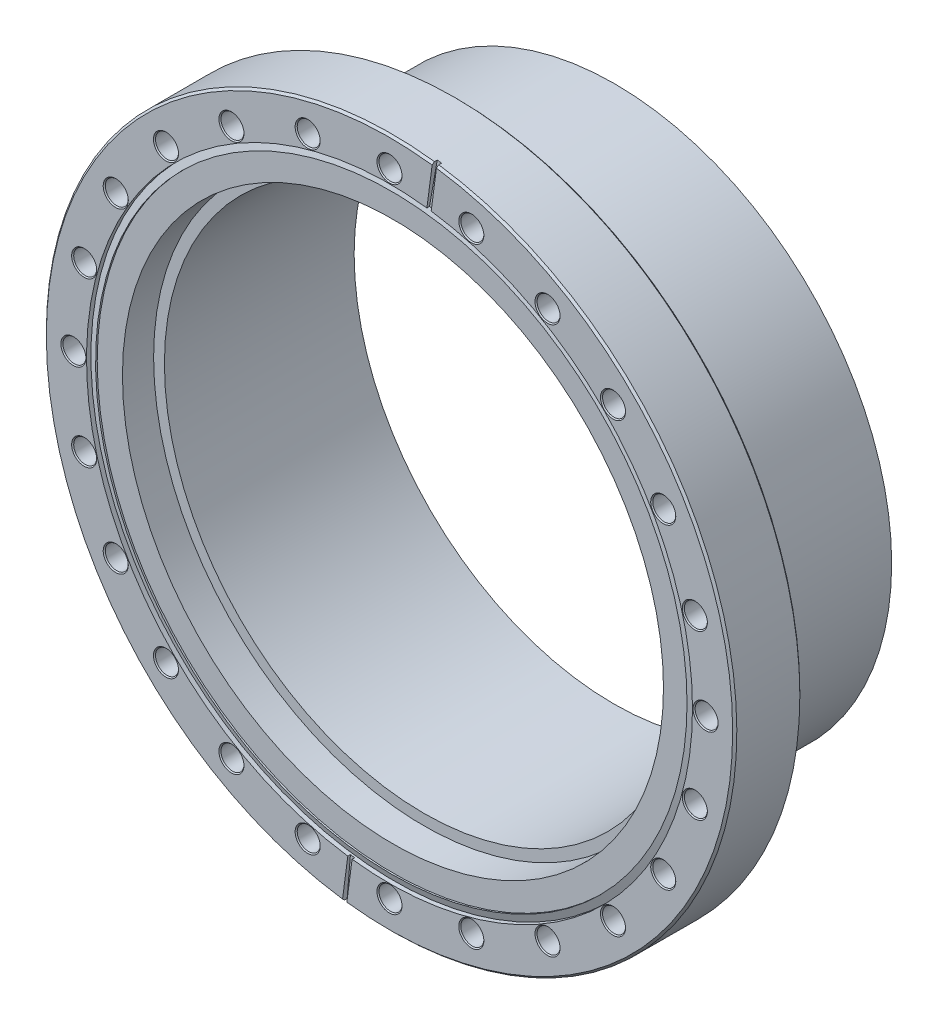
ISO-10303-21;
HEADER;
FILE_DESCRIPTION(('STEP AP214'),'2;1');
FILE_NAME('part.step','',(''),(''),'','','');
FILE_SCHEMA(('AUTOMOTIVE_DESIGN { 1 0 10303 214 1 1 1 1 }'));
ENDSEC;
DATA;
#1=APPLICATION_CONTEXT('core data for automotive mechanical design processes');
#2=APPLICATION_PROTOCOL_DEFINITION('international standard','automotive_design',2000,#1);
#3=PRODUCT_CONTEXT('',#1,'mechanical');
#4=PRODUCT('Part','Part','',(#3));
#5=PRODUCT_RELATED_PRODUCT_CATEGORY('part','',(#4));
#6=PRODUCT_DEFINITION_FORMATION('','',#4);
#7=PRODUCT_DEFINITION_CONTEXT('part definition',#1,'design');
#8=PRODUCT_DEFINITION('design','',#6,#7);
#9=PRODUCT_DEFINITION_SHAPE('','',#8);
#10=(LENGTH_UNIT() NAMED_UNIT(*) SI_UNIT(.MILLI.,.METRE.));
#11=(NAMED_UNIT(*) PLANE_ANGLE_UNIT() SI_UNIT($,.RADIAN.));
#12=(NAMED_UNIT(*) SI_UNIT($,.STERADIAN.) SOLID_ANGLE_UNIT());
#13=UNCERTAINTY_MEASURE_WITH_UNIT(LENGTH_MEASURE(1.E-05),#10,'distance_accuracy_value','');
#14=(GEOMETRIC_REPRESENTATION_CONTEXT(3) GLOBAL_UNCERTAINTY_ASSIGNED_CONTEXT((#13)) GLOBAL_UNIT_ASSIGNED_CONTEXT((#10,
#11,#12)) REPRESENTATION_CONTEXT('',''));
#15=CARTESIAN_POINT('',(0.,0.,0.));
#16=DIRECTION('',(0.,0.,1.));
#17=DIRECTION('',(1.,0.,0.));
#18=AXIS2_PLACEMENT_3D('',#15,#16,#17);
#19=CARTESIAN_POINT('',(0.,0.,0.));
#20=DIRECTION('',(0.,0.,1.));
#21=DIRECTION('',(1.,0.,0.));
#22=AXIS2_PLACEMENT_3D('',#19,#20,#21);
#23=CYLINDRICAL_SURFACE('',#22,101.6);
#24=CARTESIAN_POINT('',(0.,0.,-12.7));
#25=DIRECTION('',(0.,0.,1.));
#26=DIRECTION('',(1.,0.,0.));
#27=AXIS2_PLACEMENT_3D('',#24,#25,#26);
#28=CIRCLE('',#27,101.6);
#29=CARTESIAN_POINT('',(101.6,0.,-12.7));
#30=VERTEX_POINT('',#29);
#31=EDGE_CURVE('E759',#30,#30,#28,.T.);
#32=ORIENTED_EDGE('',*,*,#31,.F.);
#33=EDGE_LOOP('',(#32));
#34=FACE_BOUND('',#33,.T.);
#35=CARTESIAN_POINT('',(0.,0.,-82.5704398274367));
#36=DIRECTION('',(0.,0.,-1.));
#37=DIRECTION('',(-1.,0.,0.));
#38=AXIS2_PLACEMENT_3D('',#35,#36,#37);
#39=CIRCLE('',#38,101.6);
#40=CARTESIAN_POINT('',(-101.6,0.,-82.5704398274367));
#41=VERTEX_POINT('',#40);
#42=EDGE_CURVE('E1531',#41,#41,#39,.F.);
#43=ORIENTED_EDGE('',*,*,#42,.T.);
#44=EDGE_LOOP('',(#43));
#45=FACE_BOUND('',#44,.T.);
#46=ADVANCED_FACE('F37',(#34,#45),#23,.T.);
#47=CARTESIAN_POINT('',(0.,0.,0.));
#48=DIRECTION('',(0.,0.,1.));
#49=DIRECTION('',(1.,0.,0.));
#50=AXIS2_PLACEMENT_3D('',#47,#48,#49);
#51=CYLINDRICAL_SURFACE('',#50,95.25);
#52=CARTESIAN_POINT('',(0.,0.,-12.7));
#53=DIRECTION('',(0.,0.,1.));
#54=DIRECTION('',(1.,0.,0.));
#55=AXIS2_PLACEMENT_3D('',#52,#53,#54);
#56=CIRCLE('',#55,95.25);
#57=CARTESIAN_POINT('',(95.25,0.,-12.7));
#58=VERTEX_POINT('',#57);
#59=EDGE_CURVE('E764',#58,#58,#56,.T.);
#60=ORIENTED_EDGE('',*,*,#59,.T.);
#61=EDGE_LOOP('',(#60));
#62=FACE_BOUND('',#61,.T.);
#63=CARTESIAN_POINT('',(0.,0.,-82.2802252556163));
#64=DIRECTION('',(0.,0.,-1.));
#65=DIRECTION('',(-1.,0.,0.));
#66=AXIS2_PLACEMENT_3D('',#63,#64,#65);
#67=CIRCLE('',#66,95.25);
#68=CARTESIAN_POINT('',(-95.25,0.,-82.2802252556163));
#69=VERTEX_POINT('',#68);
#70=EDGE_CURVE('E41',#69,#69,#67,.T.);
#71=ORIENTED_EDGE('',*,*,#70,.T.);
#72=EDGE_LOOP('',(#71));
#73=FACE_BOUND('',#72,.T.);
#74=ADVANCED_FACE('F208',(#62,#73),#51,.F.);
#75=CARTESIAN_POINT('',(0.,0.,-1.71266404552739));
#76=DIRECTION('',(0.,0.,1.));
#77=DIRECTION('',(1.,0.,0.));
#78=AXIS2_PLACEMENT_3D('',#75,#76,#77);
#79=CYLINDRICAL_SURFACE('',#78,108.458);
#80=CARTESIAN_POINT('',(0.,0.,-0.66039999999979));
#81=DIRECTION('',(0.,0.,-1.));
#82=DIRECTION('',(0.,-1.,0.));
#83=AXIS2_PLACEMENT_3D('',#80,#81,#82);
#84=CIRCLE('',#83,108.458);
#85=CARTESIAN_POINT('',(0.,-108.458,-0.66039999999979));
#86=VERTEX_POINT('',#85);
#87=EDGE_CURVE('E582',#86,#86,#84,.T.);
#88=ORIENTED_EDGE('',*,*,#87,.F.);
#89=EDGE_LOOP('',(#88));
#90=FACE_BOUND('',#89,.T.);
#91=CARTESIAN_POINT('',(0.,0.,-1.27));
#92=DIRECTION('',(0.,0.,1.));
#93=DIRECTION('',(1.,0.,0.));
#94=AXIS2_PLACEMENT_3D('',#91,#92,#93);
#95=CIRCLE('',#94,108.458);
#96=CARTESIAN_POINT('',(108.458,0.,-1.27));
#97=VERTEX_POINT('',#96);
#98=EDGE_CURVE('E584',#97,#97,#95,.T.);
#99=ORIENTED_EDGE('',*,*,#98,.F.);
#100=EDGE_LOOP('',(#99));
#101=FACE_BOUND('',#100,.T.);
#102=ADVANCED_FACE('F39',(#90,#101),#79,.F.);
#103=CARTESIAN_POINT('',(-13.6514564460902,-109.774261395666,-0.9398));
#104=DIRECTION('',(-0.00683121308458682,-0.0518882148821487,0.998629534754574));
#105=DIRECTION('',(0.,-0.998652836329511,-0.0518894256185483));
#106=AXIS2_PLACEMENT_3D('',#103,#104,#105);
#107=PLANE('',#106);
#108=DIRECTION('',(-0.130347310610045,-0.990086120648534,-0.0523359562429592));
#109=VECTOR('',#108,1.);
#110=CARTESIAN_POINT('',(-15.2913124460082,-110.067894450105,-0.966274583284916));
#111=LINE('',#110,#109);
#112=CARTESIAN_POINT('',(-15.2913124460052,-110.067894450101,-0.966274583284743));
#113=VERTEX_POINT('',#112);
#114=CARTESIAN_POINT('',(-17.3137305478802,-125.429685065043,-1.77829889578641));
#115=VERTEX_POINT('',#114);
#116=EDGE_CURVE('E146',#113,#115,#111,.T.);
#117=ORIENTED_EDGE('',*,*,#116,.T.);
#118=CARTESIAN_POINT('',(0.,0.,4.85739132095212));
#119=DIRECTION('',(-0.00683121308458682,-0.0518882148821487,0.998629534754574));
#120=DIRECTION('',(-0.130347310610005,-0.99008612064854,-0.0523359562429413));
#121=AXIS2_PLACEMENT_3D('',#118,#119,#120);
#122=ELLIPSE('',#121,126.792765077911,126.619);
#123=CARTESIAN_POINT('',(-15.7398118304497,-125.636895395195,-1.77829889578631));
#124=VERTEX_POINT('',#123);
#125=EDGE_CURVE('E756',#115,#124,#122,.T.);
#126=ORIENTED_EDGE('',*,*,#125,.T.);
#127=DIRECTION('',(-0.130347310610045,-0.990086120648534,-0.0523359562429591));
#128=VECTOR('',#127,1.);
#129=CARTESIAN_POINT('',(-13.7173937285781,-110.27510478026,-0.966274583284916));
#130=LINE('',#129,#128);
#131=CARTESIAN_POINT('',(-13.7173937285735,-110.275104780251,-0.966274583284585));
#132=VERTEX_POINT('',#131);
#133=EDGE_CURVE('E581',#132,#124,#130,.T.);
#134=ORIENTED_EDGE('',*,*,#133,.F.);
#135=CARTESIAN_POINT('',(0.,0.,4.85739132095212));
#136=DIRECTION('',(-0.00683121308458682,-0.0518882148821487,0.998629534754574));
#137=DIRECTION('',(0.130347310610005,0.99008612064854,0.0523359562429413));
#138=AXIS2_PLACEMENT_3D('',#135,#136,#137);
#139=ELLIPSE('',#138,111.277501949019,111.125);
#140=EDGE_CURVE('E90',#132,#113,#139,.F.);
#141=ORIENTED_EDGE('',*,*,#140,.T.);
#142=EDGE_LOOP('',(#117,#126,#134,#141));
#143=FACE_BOUND('',#142,.T.);
#144=ADVANCED_FACE('F931',(#143),#107,.T.);
#145=CARTESIAN_POINT('',(15.225375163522,109.56705106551,-0.9398));
#146=DIRECTION('',(-0.00683121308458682,-0.0518882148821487,-0.998629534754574));
#147=DIRECTION('',(0.,0.998652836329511,-0.0518894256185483));
#148=AXIS2_PLACEMENT_3D('',#145,#146,#147);
#149=PLANE('',#148);
#150=CARTESIAN_POINT('',(0.,0.,4.8573913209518));
#151=DIRECTION('',(-0.00683121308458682,-0.0518882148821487,-0.998629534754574));
#152=DIRECTION('',(-0.130347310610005,-0.99008612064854,0.0523359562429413));
#153=AXIS2_PLACEMENT_3D('',#150,#151,#152);
#154=ELLIPSE('',#153,111.277501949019,111.125);
#155=CARTESIAN_POINT('',(15.2913124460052,110.067894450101,-0.966274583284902));
#156=VERTEX_POINT('',#155);
#157=CARTESIAN_POINT('',(13.7173937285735,110.275104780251,-0.966274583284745));
#158=VERTEX_POINT('',#157);
#159=EDGE_CURVE('E585',#156,#158,#154,.F.);
#160=ORIENTED_EDGE('',*,*,#159,.F.);
#161=DIRECTION('',(0.130347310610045,0.990086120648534,-0.0523359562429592));
#162=VECTOR('',#161,1.);
#163=CARTESIAN_POINT('',(15.2913124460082,110.067894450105,-0.966274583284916));
#164=LINE('',#163,#162);
#165=CARTESIAN_POINT('',(17.3137305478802,125.429685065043,-1.77829889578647));
#166=VERTEX_POINT('',#165);
#167=EDGE_CURVE('E141',#156,#166,#164,.T.);
#168=ORIENTED_EDGE('',*,*,#167,.T.);
#169=CARTESIAN_POINT('',(0.,0.,4.85739132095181));
#170=DIRECTION('',(-0.00683121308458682,-0.0518882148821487,-0.998629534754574));
#171=DIRECTION('',(0.130347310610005,0.99008612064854,-0.0523359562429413));
#172=AXIS2_PLACEMENT_3D('',#169,#170,#171);
#173=ELLIPSE('',#172,126.792765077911,126.619);
#174=CARTESIAN_POINT('',(15.7398118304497,125.636895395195,-1.77829889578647));
#175=VERTEX_POINT('',#174);
#176=EDGE_CURVE('E137',#175,#166,#173,.T.);
#177=ORIENTED_EDGE('',*,*,#176,.F.);
#178=DIRECTION('',(0.130347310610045,0.990086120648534,-0.0523359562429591));
#179=VECTOR('',#178,1.);
#180=CARTESIAN_POINT('',(13.7173937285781,110.27510478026,-0.966274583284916));
#181=LINE('',#180,#179);
#182=EDGE_CURVE('E572',#158,#175,#181,.T.);
#183=ORIENTED_EDGE('',*,*,#182,.F.);
#184=EDGE_LOOP('',(#160,#168,#177,#183));
#185=FACE_BOUND('',#184,.T.);
#186=ADVANCED_FACE('F927',(#185),#149,.F.);
#187=CARTESIAN_POINT('',(0.,0.,-1.63110861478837));
#188=DIRECTION('',(0.,0.,-1.));
#189=DIRECTION('',(-1.,0.,0.));
#190=AXIS2_PLACEMENT_3D('',#187,#188,#189);
#191=CONICAL_SURFACE('',#190,111.125,1.2217304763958);
#192=ORIENTED_EDGE('',*,*,#87,.T.);
#193=EDGE_LOOP('',(#192));
#194=FACE_BOUND('',#193,.T.);
#195=CARTESIAN_POINT('',(0.,0.,-1.63110861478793));
#196=DIRECTION('',(0.,0.,1.));
#197=DIRECTION('',(1.,0.,0.));
#198=AXIS2_PLACEMENT_3D('',#195,#196,#197);
#199=CIRCLE('',#198,111.125);
#200=CARTESIAN_POINT('',(111.125,0.,-1.63110861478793));
#201=VERTEX_POINT('',#200);
#202=EDGE_CURVE('E562',#201,#201,#199,.T.);
#203=ORIENTED_EDGE('',*,*,#202,.T.);
#204=EDGE_LOOP('',(#203));
#205=FACE_BOUND('',#204,.T.);
#206=ADVANCED_FACE('F937',(#194,#205),#191,.T.);
#207=CARTESIAN_POINT('',(0.,0.,-1.27));
#208=DIRECTION('',(0.,0.,1.));
#209=DIRECTION('',(1.,0.,0.));
#210=AXIS2_PLACEMENT_3D('',#207,#208,#209);
#211=PLANE('',#210);
#212=CARTESIAN_POINT('',(0.,0.,-1.27));
#213=DIRECTION('',(0.,0.,-1.));
#214=DIRECTION('',(-1.,0.,0.));
#215=AXIS2_PLACEMENT_3D('',#212,#213,#214);
#216=CIRCLE('',#215,99.2124);
#217=CARTESIAN_POINT('',(-99.2124,0.,-1.27));
#218=VERTEX_POINT('',#217);
#219=EDGE_CURVE('E560',#218,#218,#216,.T.);
#220=ORIENTED_EDGE('',*,*,#219,.T.);
#221=EDGE_LOOP('',(#220));
#222=FACE_BOUND('',#221,.T.);
#223=ORIENTED_EDGE('',*,*,#98,.T.);
#224=EDGE_LOOP('',(#223));
#225=FACE_BOUND('',#224,.T.);
#226=ADVANCED_FACE('F933',(#222,#225),#211,.T.);
#227=CARTESIAN_POINT('',(0.786959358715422,-0.103605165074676,0.));
#228=DIRECTION('',(-0.991444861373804,0.130526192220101,0.));
#229=DIRECTION('',(-0.130526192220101,-0.991444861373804,0.));
#230=AXIS2_PLACEMENT_3D('',#227,#228,#229);
#231=PLANE('',#230);
#232=DIRECTION('',(0.0922968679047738,0.701064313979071,0.70709979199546));
#233=VECTOR('',#232,1.);
#234=CARTESIAN_POINT('',(-15.7398118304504,-125.6368953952,-0.762000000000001));
#235=LINE('',#234,#233);
#236=CARTESIAN_POINT('',(-15.7398118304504,-125.6368953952,-0.761999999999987));
#237=VERTEX_POINT('',#236);
#238=CARTESIAN_POINT('',(-15.6403489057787,-124.881399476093,-2.6478929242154E-12));
#239=VERTEX_POINT('',#238);
#240=EDGE_CURVE('E56',#237,#239,#235,.T.);
#241=ORIENTED_EDGE('',*,*,#240,.T.);
#242=DIRECTION('',(0.130526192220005,0.991444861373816,0.));
#243=VECTOR('',#242,1.);
#244=CARTESIAN_POINT('',(-15.6403489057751,-124.881399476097,0.));
#245=LINE('',#244,#243);
#246=CARTESIAN_POINT('',(-13.7173937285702,-110.275104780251,0.));
#247=VERTEX_POINT('',#246);
#248=EDGE_CURVE('E559',#239,#247,#245,.T.);
#249=ORIENTED_EDGE('',*,*,#248,.T.);
#250=DIRECTION('',(0.,0.,1.));
#251=VECTOR('',#250,1.);
#252=CARTESIAN_POINT('',(-13.7173937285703,-110.275104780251,-1.71266404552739));
#253=LINE('',#252,#251);
#254=EDGE_CURVE('E742',#247,#132,#253,.F.);
#255=ORIENTED_EDGE('',*,*,#254,.T.);
#256=ORIENTED_EDGE('',*,*,#133,.T.);
#257=DIRECTION('',(0.,0.,1.));
#258=VECTOR('',#257,1.);
#259=CARTESIAN_POINT('',(-15.7398118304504,-125.6368953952,0.));
#260=LINE('',#259,#258);
#261=EDGE_CURVE('E579',#124,#237,#260,.T.);
#262=ORIENTED_EDGE('',*,*,#261,.T.);
#263=EDGE_LOOP('',(#241,#249,#255,#256,#262));
#264=FACE_BOUND('',#263,.T.);
#265=ADVANCED_FACE('F205',(#264),#231,.T.);
#266=CARTESIAN_POINT('',(0.786959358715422,-0.103605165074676,0.));
#267=DIRECTION('',(0.991444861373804,-0.130526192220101,0.));
#268=DIRECTION('',(0.130526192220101,0.991444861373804,0.));
#269=AXIS2_PLACEMENT_3D('',#266,#267,#268);
#270=PLANE('',#269);
#271=DIRECTION('',(0.,0.,1.));
#272=VECTOR('',#271,1.);
#273=CARTESIAN_POINT('',(17.3137305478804,125.429685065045,0.));
#274=LINE('',#273,#272);
#275=CARTESIAN_POINT('',(17.3137305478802,125.429685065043,-0.762000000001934));
#276=VERTEX_POINT('',#275);
#277=EDGE_CURVE('E134',#166,#276,#274,.T.);
#278=ORIENTED_EDGE('',*,*,#277,.F.);
#279=ORIENTED_EDGE('',*,*,#167,.F.);
#280=DIRECTION('',(0.,0.,1.));
#281=VECTOR('',#280,1.);
#282=CARTESIAN_POINT('',(15.2913124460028,110.067894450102,-1.71266404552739));
#283=LINE('',#282,#281);
#284=CARTESIAN_POINT('',(15.2913124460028,110.067894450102,0.));
#285=VERTEX_POINT('',#284);
#286=EDGE_CURVE('E564',#156,#285,#283,.T.);
#287=ORIENTED_EDGE('',*,*,#286,.T.);
#288=DIRECTION('',(0.130526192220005,0.991444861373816,0.));
#289=VECTOR('',#288,1.);
#290=CARTESIAN_POINT('',(15.2913124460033,110.067894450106,0.));
#291=LINE('',#290,#289);
#292=CARTESIAN_POINT('',(17.2142676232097,124.674189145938,-2.67299408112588E-12));
#293=VERTEX_POINT('',#292);
#294=EDGE_CURVE('E144',#285,#293,#291,.T.);
#295=ORIENTED_EDGE('',*,*,#294,.T.);
#296=CARTESIAN_POINT('',(17.3137305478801,125.429685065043,-0.76200000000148));
#297=CARTESIAN_POINT('',(17.2971533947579,125.303769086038,-0.634999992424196));
#298=CARTESIAN_POINT('',(17.2805762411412,125.177853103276,-0.507999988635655));
#299=CARTESIAN_POINT('',(17.2474219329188,124.926021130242,-0.253999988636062));
#300=CARTESIAN_POINT('',(17.2308447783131,124.800105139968,-0.126999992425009));
#301=CARTESIAN_POINT('',(17.2142676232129,124.674189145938,-2.6987807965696E-12));
#302=B_SPLINE_CURVE_WITH_KNOTS('',3,(#296,#297,#298,#299,#300,#301),.UNSPECIFIED.,.F.,.F.,(4,2,
4),(0.,0.538820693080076,1.07764138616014),.UNSPECIFIED.);
#303=EDGE_CURVE('E126',#276,#293,#302,.T.);
#304=ORIENTED_EDGE('',*,*,#303,.F.);
#305=EDGE_LOOP('',(#278,#279,#287,#295,#304));
#306=FACE_BOUND('',#305,.T.);
#307=ADVANCED_FACE('F143',(#306),#270,.F.);
#308=CARTESIAN_POINT('',(-0.786959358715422,0.103605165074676,0.));
#309=DIRECTION('',(-0.991444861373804,0.130526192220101,0.));
#310=DIRECTION('',(-0.130526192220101,-0.991444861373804,0.));
#311=AXIS2_PLACEMENT_3D('',#308,#309,#310);
#312=PLANE('',#311);
#313=DIRECTION('',(0.,0.,1.));
#314=VECTOR('',#313,1.);
#315=CARTESIAN_POINT('',(-17.3137305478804,-125.429685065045,0.));
#316=LINE('',#315,#314);
#317=CARTESIAN_POINT('',(-17.3137305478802,-125.429685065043,-0.762000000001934));
#318=VERTEX_POINT('',#317);
#319=EDGE_CURVE('E148',#115,#318,#316,.T.);
#320=ORIENTED_EDGE('',*,*,#319,.F.);
#321=ORIENTED_EDGE('',*,*,#116,.F.);
#322=DIRECTION('',(0.,0.,1.));
#323=VECTOR('',#322,1.);
#324=CARTESIAN_POINT('',(-15.2913124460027,-110.067894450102,-1.71266404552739));
#325=LINE('',#324,#323);
#326=CARTESIAN_POINT('',(-15.2913124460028,-110.067894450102,0.));
#327=VERTEX_POINT('',#326);
#328=EDGE_CURVE('E739',#113,#327,#325,.T.);
#329=ORIENTED_EDGE('',*,*,#328,.T.);
#330=DIRECTION('',(-0.130526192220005,-0.991444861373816,0.));
#331=VECTOR('',#330,1.);
#332=CARTESIAN_POINT('',(-15.2913124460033,-110.067894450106,0.));
#333=LINE('',#332,#331);
#334=CARTESIAN_POINT('',(-17.2142676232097,-124.674189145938,-2.66937038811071E-12));
#335=VERTEX_POINT('',#334);
#336=EDGE_CURVE('E732',#327,#335,#333,.T.);
#337=ORIENTED_EDGE('',*,*,#336,.T.);
#338=CARTESIAN_POINT('',(-17.3137305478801,-125.429685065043,-0.76200000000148));
#339=CARTESIAN_POINT('',(-17.2971533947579,-125.303769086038,-0.634999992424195));
#340=CARTESIAN_POINT('',(-17.2805762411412,-125.177853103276,-0.507999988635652));
#341=CARTESIAN_POINT('',(-17.2474219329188,-124.926021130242,-0.253999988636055));
#342=CARTESIAN_POINT('',(-17.2308447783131,-124.800105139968,-0.126999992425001));
#343=CARTESIAN_POINT('',(-17.2142676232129,-124.674189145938,-2.68956279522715E-12));
#344=B_SPLINE_CURVE_WITH_KNOTS('',3,(#338,#339,#340,#341,#342,#343),.UNSPECIFIED.,.F.,.F.,(4,2,
4),(0.,0.53882069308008,1.07764138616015),.UNSPECIFIED.);
#345=EDGE_CURVE('E158',#318,#335,#344,.T.);
#346=ORIENTED_EDGE('',*,*,#345,.F.);
#347=EDGE_LOOP('',(#320,#321,#329,#337,#346));
#348=FACE_BOUND('',#347,.T.);
#349=ADVANCED_FACE('F197',(#348),#312,.F.);
#350=CARTESIAN_POINT('',(-0.786959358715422,0.103605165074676,0.));
#351=DIRECTION('',(0.991444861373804,-0.130526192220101,0.));
#352=DIRECTION('',(0.130526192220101,0.991444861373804,0.));
#353=AXIS2_PLACEMENT_3D('',#350,#351,#352);
#354=PLANE('',#353);
#355=DIRECTION('',(-0.0922968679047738,-0.701064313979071,0.70709979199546));
#356=VECTOR('',#355,1.);
#357=CARTESIAN_POINT('',(15.7398118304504,125.6368953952,-0.762000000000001));
#358=LINE('',#357,#356);
#359=CARTESIAN_POINT('',(15.7398118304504,125.6368953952,-0.761999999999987));
#360=VERTEX_POINT('',#359);
#361=CARTESIAN_POINT('',(15.6403489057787,124.881399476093,-2.64789258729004E-12));
#362=VERTEX_POINT('',#361);
#363=EDGE_CURVE('E563',#360,#362,#358,.T.);
#364=ORIENTED_EDGE('',*,*,#363,.T.);
#365=DIRECTION('',(-0.130526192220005,-0.991444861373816,0.));
#366=VECTOR('',#365,1.);
#367=CARTESIAN_POINT('',(15.6403489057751,124.881399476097,0.));
#368=LINE('',#367,#366);
#369=CARTESIAN_POINT('',(13.7173937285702,110.275104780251,0.));
#370=VERTEX_POINT('',#369);
#371=EDGE_CURVE('E557',#362,#370,#368,.T.);
#372=ORIENTED_EDGE('',*,*,#371,.T.);
#373=DIRECTION('',(0.,0.,1.));
#374=VECTOR('',#373,1.);
#375=CARTESIAN_POINT('',(13.7173937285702,110.275104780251,-1.71266404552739));
#376=LINE('',#375,#374);
#377=EDGE_CURVE('E570',#370,#158,#376,.F.);
#378=ORIENTED_EDGE('',*,*,#377,.T.);
#379=ORIENTED_EDGE('',*,*,#182,.T.);
#380=DIRECTION('',(0.,0.,1.));
#381=VECTOR('',#380,1.);
#382=CARTESIAN_POINT('',(15.7398118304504,125.6368953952,0.));
#383=LINE('',#382,#381);
#384=EDGE_CURVE('E565',#175,#360,#383,.T.);
#385=ORIENTED_EDGE('',*,*,#384,.T.);
#386=EDGE_LOOP('',(#364,#372,#378,#379,#385));
#387=FACE_BOUND('',#386,.T.);
#388=ADVANCED_FACE('F194',(#387),#354,.T.);
#389=CARTESIAN_POINT('',(0.,0.,-1.71266404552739));
#390=DIRECTION('',(0.,0.,1.));
#391=DIRECTION('',(1.,0.,0.));
#392=AXIS2_PLACEMENT_3D('',#389,#390,#391);
#393=CYLINDRICAL_SURFACE('',#392,111.125);
#394=ORIENTED_EDGE('',*,*,#202,.F.);
#395=EDGE_LOOP('',(#394));
#396=FACE_BOUND('',#395,.T.);
#397=ORIENTED_EDGE('',*,*,#254,.F.);
#398=CARTESIAN_POINT('',(0.,0.,0.));
#399=DIRECTION('',(0.,0.,1.));
#400=DIRECTION('',(1.,0.,0.));
#401=AXIS2_PLACEMENT_3D('',#398,#399,#400);
#402=CIRCLE('',#401,111.125);
#403=EDGE_CURVE('E102',#247,#285,#402,.T.);
#404=ORIENTED_EDGE('',*,*,#403,.T.);
#405=ORIENTED_EDGE('',*,*,#286,.F.);
#406=ORIENTED_EDGE('',*,*,#159,.T.);
#407=ORIENTED_EDGE('',*,*,#377,.F.);
#408=CARTESIAN_POINT('',(0.,0.,0.));
#409=DIRECTION('',(0.,0.,1.));
#410=DIRECTION('',(1.,0.,0.));
#411=AXIS2_PLACEMENT_3D('',#408,#409,#410);
#412=CIRCLE('',#411,111.125);
#413=EDGE_CURVE('E554',#370,#327,#412,.T.);
#414=ORIENTED_EDGE('',*,*,#413,.T.);
#415=ORIENTED_EDGE('',*,*,#328,.F.);
#416=ORIENTED_EDGE('',*,*,#140,.F.);
#417=EDGE_LOOP('',(#397,#404,#405,#406,#407,#414,#415,#416));
#418=FACE_BOUND('',#417,.T.);
#419=ADVANCED_FACE('F190',(#396,#418),#393,.F.);
#420=CARTESIAN_POINT('',(0.,0.,-1.27));
#421=DIRECTION('',(0.,0.,-1.));
#422=DIRECTION('',(-1.,0.,0.));
#423=AXIS2_PLACEMENT_3D('',#420,#421,#422);
#424=CYLINDRICAL_SURFACE('',#423,99.2124);
#425=ORIENTED_EDGE('',*,*,#219,.F.);
#426=EDGE_LOOP('',(#425));
#427=FACE_BOUND('',#426,.T.);
#428=CARTESIAN_POINT('',(0.,0.,-12.7));
#429=DIRECTION('',(0.,0.,1.));
#430=DIRECTION('',(1.,0.,0.));
#431=AXIS2_PLACEMENT_3D('',#428,#429,#430);
#432=CIRCLE('',#431,99.2124);
#433=CARTESIAN_POINT('',(99.2124,0.,-12.7));
#434=VERTEX_POINT('',#433);
#435=EDGE_CURVE('E757',#434,#434,#432,.F.);
#436=ORIENTED_EDGE('',*,*,#435,.T.);
#437=EDGE_LOOP('',(#436));
#438=FACE_BOUND('',#437,.T.);
#439=ADVANCED_FACE('F186',(#427,#438),#424,.F.);
#440=CARTESIAN_POINT('',(0.,0.,0.));
#441=DIRECTION('',(0.,0.,-1.));
#442=DIRECTION('',(-1.,0.,0.));
#443=AXIS2_PLACEMENT_3D('',#440,#441,#442);
#444=PLANE('',#443);
#445=CARTESIAN_POINT('',(0.,-115.9256,0.));
#446=DIRECTION('',(0.,0.,1.));
#447=DIRECTION('',(1.,0.,0.));
#448=AXIS2_PLACEMENT_3D('',#445,#446,#447);
#449=CIRCLE('',#448,4.59740000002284);
#450=CARTESIAN_POINT('',(4.59740000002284,-115.9256,0.));
#451=VERTEX_POINT('',#450);
#452=EDGE_CURVE('E697',#451,#451,#449,.F.);
#453=ORIENTED_EDGE('',*,*,#452,.T.);
#454=EDGE_LOOP('',(#453));
#455=FACE_BOUND('',#454,.T.);
#456=CARTESIAN_POINT('',(30.0037530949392,-111.975530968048,0.));
#457=DIRECTION('',(0.,0.,1.));
#458=DIRECTION('',(1.,0.,0.));
#459=AXIS2_PLACEMENT_3D('',#456,#457,#458);
#460=CIRCLE('',#459,4.59739999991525);
#461=CARTESIAN_POINT('',(34.6011530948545,-111.975530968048,0.));
#462=VERTEX_POINT('',#461);
#463=EDGE_CURVE('E700',#462,#462,#460,.F.);
#464=ORIENTED_EDGE('',*,*,#463,.T.);
#465=EDGE_LOOP('',(#464));
#466=FACE_BOUND('',#465,.T.);
#467=CARTESIAN_POINT('',(57.9628,-100.394514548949,5.6843418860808E-11));
#468=DIRECTION('',(0.,0.,1.));
#469=DIRECTION('',(1.,0.,0.));
#470=AXIS2_PLACEMENT_3D('',#467,#468,#469);
#471=CIRCLE('',#470,4.59740000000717);
#472=CARTESIAN_POINT('',(62.5602000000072,-100.394514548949,5.6843418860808E-11));
#473=VERTEX_POINT('',#472);
#474=EDGE_CURVE('E703',#473,#473,#471,.F.);
#475=ORIENTED_EDGE('',*,*,#474,.T.);
#476=EDGE_LOOP('',(#475));
#477=FACE_BOUND('',#476,.T.);
#478=CARTESIAN_POINT('',(81.971777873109,-81.971777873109,0.));
#479=DIRECTION('',(0.,0.,1.));
#480=DIRECTION('',(1.,0.,0.));
#481=AXIS2_PLACEMENT_3D('',#478,#479,#480);
#482=CIRCLE('',#481,4.59739999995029);
#483=CARTESIAN_POINT('',(86.5691778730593,-81.971777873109,0.));
#484=VERTEX_POINT('',#483);
#485=EDGE_CURVE('E706',#484,#484,#482,.F.);
#486=ORIENTED_EDGE('',*,*,#485,.T.);
#487=EDGE_LOOP('',(#486));
#488=FACE_BOUND('',#487,.T.);
#489=CARTESIAN_POINT('',(100.394514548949,-57.9628,5.6843418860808E-11));
#490=DIRECTION('',(0.,0.,1.));
#491=DIRECTION('',(1.,0.,0.));
#492=AXIS2_PLACEMENT_3D('',#489,#490,#491);
#493=CIRCLE('',#492,4.59740000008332);
#494=CARTESIAN_POINT('',(104.991914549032,-57.9628,5.6843418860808E-11));
#495=VERTEX_POINT('',#494);
#496=EDGE_CURVE('E709',#495,#495,#493,.F.);
#497=ORIENTED_EDGE('',*,*,#496,.T.);
#498=EDGE_LOOP('',(#497));
#499=FACE_BOUND('',#498,.T.);
#500=CARTESIAN_POINT('',(111.975530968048,-30.0037530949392,0.));
#501=DIRECTION('',(0.,0.,1.));
#502=DIRECTION('',(1.,0.,0.));
#503=AXIS2_PLACEMENT_3D('',#500,#501,#502);
#504=CIRCLE('',#503,4.5973999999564);
#505=CARTESIAN_POINT('',(116.572930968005,-30.0037530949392,0.));
#506=VERTEX_POINT('',#505);
#507=EDGE_CURVE('E712',#506,#506,#504,.F.);
#508=ORIENTED_EDGE('',*,*,#507,.T.);
#509=EDGE_LOOP('',(#508));
#510=FACE_BOUND('',#509,.T.);
#511=CARTESIAN_POINT('',(115.9256,0.,5.6843418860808E-11));
#512=DIRECTION('',(0.,0.,1.));
#513=DIRECTION('',(1.,0.,0.));
#514=AXIS2_PLACEMENT_3D('',#511,#512,#513);
#515=CIRCLE('',#514,4.59740000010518);
#516=CARTESIAN_POINT('',(120.523000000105,0.,5.6843418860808E-11));
#517=VERTEX_POINT('',#516);
#518=EDGE_CURVE('E715',#517,#517,#515,.F.);
#519=ORIENTED_EDGE('',*,*,#518,.T.);
#520=EDGE_LOOP('',(#519));
#521=FACE_BOUND('',#520,.T.);
#522=CARTESIAN_POINT('',(111.975530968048,30.0037530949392,0.));
#523=DIRECTION('',(0.,0.,1.));
#524=DIRECTION('',(1.,0.,0.));
#525=AXIS2_PLACEMENT_3D('',#522,#523,#524);
#526=CIRCLE('',#525,4.5973999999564);
#527=CARTESIAN_POINT('',(116.572930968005,30.0037530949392,0.));
#528=VERTEX_POINT('',#527);
#529=EDGE_CURVE('E718',#528,#528,#526,.F.);
#530=ORIENTED_EDGE('',*,*,#529,.T.);
#531=EDGE_LOOP('',(#530));
#532=FACE_BOUND('',#531,.T.);
#533=CARTESIAN_POINT('',(100.394514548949,57.9628,5.6843418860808E-11));
#534=DIRECTION('',(0.,0.,1.));
#535=DIRECTION('',(1.,0.,0.));
#536=AXIS2_PLACEMENT_3D('',#533,#534,#535);
#537=CIRCLE('',#536,4.59740000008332);
#538=CARTESIAN_POINT('',(104.991914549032,57.9628,5.6843418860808E-11));
#539=VERTEX_POINT('',#538);
#540=EDGE_CURVE('E721',#539,#539,#537,.F.);
#541=ORIENTED_EDGE('',*,*,#540,.T.);
#542=EDGE_LOOP('',(#541));
#543=FACE_BOUND('',#542,.T.);
#544=CARTESIAN_POINT('',(81.971777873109,81.971777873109,0.));
#545=DIRECTION('',(0.,0.,1.));
#546=DIRECTION('',(1.,0.,0.));
#547=AXIS2_PLACEMENT_3D('',#544,#545,#546);
#548=CIRCLE('',#547,4.59739999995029);
#549=CARTESIAN_POINT('',(86.5691778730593,81.971777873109,0.));
#550=VERTEX_POINT('',#549);
#551=EDGE_CURVE('E724',#550,#550,#548,.F.);
#552=ORIENTED_EDGE('',*,*,#551,.T.);
#553=EDGE_LOOP('',(#552));
#554=FACE_BOUND('',#553,.T.);
#555=CARTESIAN_POINT('',(57.9628,100.394514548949,5.6843418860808E-11));
#556=DIRECTION('',(0.,0.,1.));
#557=DIRECTION('',(1.,0.,0.));
#558=AXIS2_PLACEMENT_3D('',#555,#556,#557);
#559=CIRCLE('',#558,4.59740000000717);
#560=CARTESIAN_POINT('',(62.5602000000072,100.394514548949,5.6843418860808E-11));
#561=VERTEX_POINT('',#560);
#562=EDGE_CURVE('E546',#561,#561,#559,.F.);
#563=ORIENTED_EDGE('',*,*,#562,.T.);
#564=EDGE_LOOP('',(#563));
#565=FACE_BOUND('',#564,.T.);
#566=CARTESIAN_POINT('',(30.0037530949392,111.975530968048,0.));
#567=DIRECTION('',(0.,0.,1.));
#568=DIRECTION('',(1.,0.,0.));
#569=AXIS2_PLACEMENT_3D('',#566,#567,#568);
#570=CIRCLE('',#569,4.59739999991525);
#571=CARTESIAN_POINT('',(34.6011530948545,111.975530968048,0.));
#572=VERTEX_POINT('',#571);
#573=EDGE_CURVE('E542',#572,#572,#570,.F.);
#574=ORIENTED_EDGE('',*,*,#573,.T.);
#575=EDGE_LOOP('',(#574));
#576=FACE_BOUND('',#575,.T.);
#577=ORIENTED_EDGE('',*,*,#294,.F.);
#578=ORIENTED_EDGE('',*,*,#403,.F.);
#579=ORIENTED_EDGE('',*,*,#248,.F.);
#580=CARTESIAN_POINT('',(0.,0.,-2.6478385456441E-12));
#581=DIRECTION('',(0.,0.,-1.));
#582=DIRECTION('',(-1.,0.,0.));
#583=AXIS2_PLACEMENT_3D('',#580,#581,#582);
#584=CIRCLE('',#583,125.857000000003);
#585=EDGE_CURVE('E543',#293,#239,#584,.T.);
#586=ORIENTED_EDGE('',*,*,#585,.F.);
#587=EDGE_LOOP('',(#577,#578,#579,#586));
#588=FACE_BOUND('',#587,.T.);
#589=ADVANCED_FACE('F182',(#455,#466,#477,#488,#499,#510,#521,#532,#543,#554,#565,#576,#588),
#444,.F.);
#590=CARTESIAN_POINT('',(0.,0.,0.));
#591=DIRECTION('',(0.,0.,-1.));
#592=DIRECTION('',(-1.,0.,0.));
#593=AXIS2_PLACEMENT_3D('',#590,#591,#592);
#594=PLANE('',#593);
#595=CARTESIAN_POINT('',(-30.0037530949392,111.975530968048,5.6843418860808E-11));
#596=DIRECTION('',(0.,0.,1.));
#597=DIRECTION('',(1.,0.,0.));
#598=AXIS2_PLACEMENT_3D('',#595,#596,#597);
#599=CIRCLE('',#598,4.59739999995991);
#600=CARTESIAN_POINT('',(-25.4063530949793,111.975530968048,5.6843418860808E-11));
#601=VERTEX_POINT('',#600);
#602=EDGE_CURVE('E664',#601,#601,#599,.F.);
#603=ORIENTED_EDGE('',*,*,#602,.T.);
#604=EDGE_LOOP('',(#603));
#605=FACE_BOUND('',#604,.T.);
#606=CARTESIAN_POINT('',(-57.9628,100.394514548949,5.6843418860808E-11));
#607=DIRECTION('',(0.,0.,1.));
#608=DIRECTION('',(1.,0.,0.));
#609=AXIS2_PLACEMENT_3D('',#606,#607,#608);
#610=CIRCLE('',#609,4.59739999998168);
#611=CARTESIAN_POINT('',(-53.3654000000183,100.394514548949,5.6843418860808E-11));
#612=VERTEX_POINT('',#611);
#613=EDGE_CURVE('E667',#612,#612,#610,.F.);
#614=ORIENTED_EDGE('',*,*,#613,.T.);
#615=EDGE_LOOP('',(#614));
#616=FACE_BOUND('',#615,.T.);
#617=CARTESIAN_POINT('',(-81.971777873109,81.971777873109,-5.6843418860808E-11));
#618=DIRECTION('',(0.,0.,1.));
#619=DIRECTION('',(1.,0.,0.));
#620=AXIS2_PLACEMENT_3D('',#617,#618,#619);
#621=CIRCLE('',#620,4.59739999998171);
#622=CARTESIAN_POINT('',(-77.3743778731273,81.971777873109,-5.6843418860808E-11));
#623=VERTEX_POINT('',#622);
#624=EDGE_CURVE('E670',#623,#623,#621,.F.);
#625=ORIENTED_EDGE('',*,*,#624,.T.);
#626=EDGE_LOOP('',(#625));
#627=FACE_BOUND('',#626,.T.);
#628=CARTESIAN_POINT('',(-100.394514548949,57.9628,-5.6843418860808E-11));
#629=DIRECTION('',(0.,0.,1.));
#630=DIRECTION('',(1.,0.,0.));
#631=AXIS2_PLACEMENT_3D('',#628,#629,#630);
#632=CIRCLE('',#631,4.59739999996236);
#633=CARTESIAN_POINT('',(-95.7971145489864,57.9628,-5.6843418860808E-11));
#634=VERTEX_POINT('',#633);
#635=EDGE_CURVE('E673',#634,#634,#632,.F.);
#636=ORIENTED_EDGE('',*,*,#635,.T.);
#637=EDGE_LOOP('',(#636));
#638=FACE_BOUND('',#637,.T.);
#639=CARTESIAN_POINT('',(-111.975530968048,30.0037530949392,-5.6843418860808E-11));
#640=DIRECTION('',(0.,0.,1.));
#641=DIRECTION('',(1.,0.,0.));
#642=AXIS2_PLACEMENT_3D('',#639,#640,#641);
#643=CIRCLE('',#642,4.5973999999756);
#644=CARTESIAN_POINT('',(-107.378130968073,30.0037530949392,-5.6843418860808E-11));
#645=VERTEX_POINT('',#644);
#646=EDGE_CURVE('E676',#645,#645,#643,.F.);
#647=ORIENTED_EDGE('',*,*,#646,.T.);
#648=EDGE_LOOP('',(#647));
#649=FACE_BOUND('',#648,.T.);
#650=CARTESIAN_POINT('',(-115.9256,0.,-5.6843418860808E-11));
#651=DIRECTION('',(0.,0.,1.));
#652=DIRECTION('',(1.,0.,0.));
#653=AXIS2_PLACEMENT_3D('',#650,#651,#652);
#654=CIRCLE('',#653,4.59739999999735);
#655=CARTESIAN_POINT('',(-111.328200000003,0.,-5.6843418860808E-11));
#656=VERTEX_POINT('',#655);
#657=EDGE_CURVE('E679',#656,#656,#654,.F.);
#658=ORIENTED_EDGE('',*,*,#657,.T.);
#659=EDGE_LOOP('',(#658));
#660=FACE_BOUND('',#659,.T.);
#661=CARTESIAN_POINT('',(-111.975530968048,-30.0037530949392,-5.6843418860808E-11));
#662=DIRECTION('',(0.,0.,1.));
#663=DIRECTION('',(1.,0.,0.));
#664=AXIS2_PLACEMENT_3D('',#661,#662,#663);
#665=CIRCLE('',#664,4.5973999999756);
#666=CARTESIAN_POINT('',(-107.378130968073,-30.0037530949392,-5.6843418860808E-11));
#667=VERTEX_POINT('',#666);
#668=EDGE_CURVE('E682',#667,#667,#665,.F.);
#669=ORIENTED_EDGE('',*,*,#668,.T.);
#670=EDGE_LOOP('',(#669));
#671=FACE_BOUND('',#670,.T.);
#672=CARTESIAN_POINT('',(-100.394514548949,-57.9628,-5.6843418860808E-11));
#673=DIRECTION('',(0.,0.,1.));
#674=DIRECTION('',(1.,0.,0.));
#675=AXIS2_PLACEMENT_3D('',#672,#673,#674);
#676=CIRCLE('',#675,4.59739999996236);
#677=CARTESIAN_POINT('',(-95.7971145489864,-57.9628,-5.6843418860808E-11));
#678=VERTEX_POINT('',#677);
#679=EDGE_CURVE('E685',#678,#678,#676,.F.);
#680=ORIENTED_EDGE('',*,*,#679,.T.);
#681=EDGE_LOOP('',(#680));
#682=FACE_BOUND('',#681,.T.);
#683=CARTESIAN_POINT('',(-81.971777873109,-81.971777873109,-5.6843418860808E-11));
#684=DIRECTION('',(0.,0.,1.));
#685=DIRECTION('',(1.,0.,0.));
#686=AXIS2_PLACEMENT_3D('',#683,#684,#685);
#687=CIRCLE('',#686,4.59739999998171);
#688=CARTESIAN_POINT('',(-77.3743778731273,-81.971777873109,-5.6843418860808E-11));
#689=VERTEX_POINT('',#688);
#690=EDGE_CURVE('E688',#689,#689,#687,.F.);
#691=ORIENTED_EDGE('',*,*,#690,.T.);
#692=EDGE_LOOP('',(#691));
#693=FACE_BOUND('',#692,.T.);
#694=CARTESIAN_POINT('',(-57.9628,-100.394514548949,5.6843418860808E-11));
#695=DIRECTION('',(0.,0.,1.));
#696=DIRECTION('',(1.,0.,0.));
#697=AXIS2_PLACEMENT_3D('',#694,#695,#696);
#698=CIRCLE('',#697,4.59739999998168);
#699=CARTESIAN_POINT('',(-53.3654000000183,-100.394514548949,5.6843418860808E-11));
#700=VERTEX_POINT('',#699);
#701=EDGE_CURVE('E691',#700,#700,#698,.F.);
#702=ORIENTED_EDGE('',*,*,#701,.T.);
#703=EDGE_LOOP('',(#702));
#704=FACE_BOUND('',#703,.T.);
#705=CARTESIAN_POINT('',(-30.0037530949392,-111.975530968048,5.6843418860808E-11));
#706=DIRECTION('',(0.,0.,1.));
#707=DIRECTION('',(1.,0.,0.));
#708=AXIS2_PLACEMENT_3D('',#705,#706,#707);
#709=CIRCLE('',#708,4.59739999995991);
#710=CARTESIAN_POINT('',(-25.4063530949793,-111.975530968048,5.6843418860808E-11));
#711=VERTEX_POINT('',#710);
#712=EDGE_CURVE('E694',#711,#711,#709,.F.);
#713=ORIENTED_EDGE('',*,*,#712,.T.);
#714=EDGE_LOOP('',(#713));
#715=FACE_BOUND('',#714,.T.);
#716=CARTESIAN_POINT('',(0.,115.9256,0.));
#717=DIRECTION('',(0.,0.,1.));
#718=DIRECTION('',(1.,0.,0.));
#719=AXIS2_PLACEMENT_3D('',#716,#717,#718);
#720=CIRCLE('',#719,4.59740000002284);
#721=CARTESIAN_POINT('',(4.59740000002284,115.9256,0.));
#722=VERTEX_POINT('',#721);
#723=EDGE_CURVE('E540',#722,#722,#720,.F.);
#724=ORIENTED_EDGE('',*,*,#723,.T.);
#725=EDGE_LOOP('',(#724));
#726=FACE_BOUND('',#725,.T.);
#727=ORIENTED_EDGE('',*,*,#413,.F.);
#728=ORIENTED_EDGE('',*,*,#371,.F.);
#729=CARTESIAN_POINT('',(0.,0.,-2.6478385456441E-12));
#730=DIRECTION('',(0.,0.,-1.));
#731=DIRECTION('',(-1.,0.,0.));
#732=AXIS2_PLACEMENT_3D('',#729,#730,#731);
#733=CIRCLE('',#732,125.857000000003);
#734=EDGE_CURVE('E548',#335,#362,#733,.T.);
#735=ORIENTED_EDGE('',*,*,#734,.F.);
#736=ORIENTED_EDGE('',*,*,#336,.F.);
#737=EDGE_LOOP('',(#727,#728,#735,#736));
#738=FACE_BOUND('',#737,.T.);
#739=ADVANCED_FACE('F178',(#605,#616,#627,#638,#649,#660,#671,#682,#693,#704,#715,#726,#738),
#594,.F.);
#740=CARTESIAN_POINT('',(0.,0.,-0.762000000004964));
#741=DIRECTION('',(0.,0.,-1.));
#742=DIRECTION('',(-1.,0.,0.));
#743=AXIS2_PLACEMENT_3D('',#740,#741,#742);
#744=CONICAL_SURFACE('',#743,126.619000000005,0.785398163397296);
#745=CARTESIAN_POINT('',(0.,0.,-0.762));
#746=DIRECTION('',(0.,0.,-1.));
#747=DIRECTION('',(-1.,0.,0.));
#748=AXIS2_PLACEMENT_3D('',#745,#746,#747);
#749=CIRCLE('',#748,126.619);
#750=EDGE_CURVE('E131',#318,#360,#749,.T.);
#751=ORIENTED_EDGE('',*,*,#750,.F.);
#752=ORIENTED_EDGE('',*,*,#345,.T.);
#753=ORIENTED_EDGE('',*,*,#734,.T.);
#754=ORIENTED_EDGE('',*,*,#363,.F.);
#755=EDGE_LOOP('',(#751,#752,#753,#754));
#756=FACE_BOUND('',#755,.T.);
#757=ADVANCED_FACE('F173',(#756),#744,.T.);
#758=CARTESIAN_POINT('',(0.,0.,-0.762000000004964));
#759=DIRECTION('',(0.,0.,-1.));
#760=DIRECTION('',(-1.,0.,0.));
#761=AXIS2_PLACEMENT_3D('',#758,#759,#760);
#762=CONICAL_SURFACE('',#761,126.619000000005,0.785398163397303);
#763=ORIENTED_EDGE('',*,*,#585,.T.);
#764=ORIENTED_EDGE('',*,*,#240,.F.);
#765=CARTESIAN_POINT('',(0.,0.,-0.762));
#766=DIRECTION('',(0.,0.,-1.));
#767=DIRECTION('',(-1.,0.,0.));
#768=AXIS2_PLACEMENT_3D('',#765,#766,#767);
#769=CIRCLE('',#768,126.619);
#770=EDGE_CURVE('E121',#276,#237,#769,.T.);
#771=ORIENTED_EDGE('',*,*,#770,.F.);
#772=ORIENTED_EDGE('',*,*,#303,.T.);
#773=EDGE_LOOP('',(#763,#764,#771,#772));
#774=FACE_BOUND('',#773,.T.);
#775=ADVANCED_FACE('F124',(#774),#762,.T.);
#776=CARTESIAN_POINT('',(0.,0.,-12.7));
#777=DIRECTION('',(0.,0.,1.));
#778=DIRECTION('',(1.,0.,0.));
#779=AXIS2_PLACEMENT_3D('',#776,#777,#778);
#780=PLANE('',#779);
#781=ORIENTED_EDGE('',*,*,#31,.T.);
#782=EDGE_LOOP('',(#781));
#783=FACE_BOUND('',#782,.T.);
#784=CARTESIAN_POINT('',(0.,0.,-12.7));
#785=DIRECTION('',(0.,0.,1.));
#786=DIRECTION('',(1.,0.,0.));
#787=AXIS2_PLACEMENT_3D('',#784,#785,#786);
#788=CIRCLE('',#787,101.854);
#789=CARTESIAN_POINT('',(101.854,0.,-12.7));
#790=VERTEX_POINT('',#789);
#791=EDGE_CURVE('E130',#790,#790,#788,.F.);
#792=ORIENTED_EDGE('',*,*,#791,.T.);
#793=EDGE_LOOP('',(#792));
#794=FACE_BOUND('',#793,.T.);
#795=ADVANCED_FACE('F172',(#783,#794),#780,.F.);
#796=CARTESIAN_POINT('',(0.,115.9256,0.));
#797=DIRECTION('',(0.,0.,1.));
#798=DIRECTION('',(1.,0.,0.));
#799=AXIS2_PLACEMENT_3D('',#796,#797,#798);
#800=CONICAL_SURFACE('',#799,4.59740000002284,0.785398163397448);
#801=CARTESIAN_POINT('',(0.,115.9256,-0.381));
#802=DIRECTION('',(0.,0.,-1.));
#803=DIRECTION('',(-1.,0.,0.));
#804=AXIS2_PLACEMENT_3D('',#801,#802,#803);
#805=CIRCLE('',#804,4.2164);
#806=CARTESIAN_POINT('',(-4.2164,115.9256,-0.381));
#807=VERTEX_POINT('',#806);
#808=EDGE_CURVE('E537',#807,#807,#805,.T.);
#809=ORIENTED_EDGE('',*,*,#808,.T.);
#810=EDGE_LOOP('',(#809));
#811=FACE_BOUND('',#810,.T.);
#812=ORIENTED_EDGE('',*,*,#723,.F.);
#813=EDGE_LOOP('',(#812));
#814=FACE_BOUND('',#813,.T.);
#815=ADVANCED_FACE('F526',(#811,#814),#800,.F.);
#816=CARTESIAN_POINT('',(30.0037530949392,111.975530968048,0.));
#817=DIRECTION('',(0.,0.,1.));
#818=DIRECTION('',(1.,0.,0.));
#819=AXIS2_PLACEMENT_3D('',#816,#817,#818);
#820=CONICAL_SURFACE('',#819,4.59739999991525,0.785398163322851);
#821=CARTESIAN_POINT('',(30.0037530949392,111.975530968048,-0.381));
#822=DIRECTION('',(0.,0.,-1.));
#823=DIRECTION('',(-1.,0.,0.));
#824=AXIS2_PLACEMENT_3D('',#821,#822,#823);
#825=CIRCLE('',#824,4.2164);
#826=CARTESIAN_POINT('',(25.7873530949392,111.975530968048,-0.381));
#827=VERTEX_POINT('',#826);
#828=EDGE_CURVE('E911',#827,#827,#825,.T.);
#829=ORIENTED_EDGE('',*,*,#828,.T.);
#830=EDGE_LOOP('',(#829));
#831=FACE_BOUND('',#830,.T.);
#832=ORIENTED_EDGE('',*,*,#573,.F.);
#833=EDGE_LOOP('',(#832));
#834=FACE_BOUND('',#833,.T.);
#835=ADVANCED_FACE('F523',(#831,#834),#820,.F.);
#836=CARTESIAN_POINT('',(57.9628,100.394514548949,5.6843418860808E-11));
#837=DIRECTION('',(0.,0.,1.));
#838=DIRECTION('',(1.,0.,0.));
#839=AXIS2_PLACEMENT_3D('',#836,#837,#838);
#840=CONICAL_SURFACE('',#839,4.59740000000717,0.785398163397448);
#841=CARTESIAN_POINT('',(57.9628,100.394514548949,-0.381));
#842=DIRECTION('',(0.,0.,-1.));
#843=DIRECTION('',(-1.,0.,0.));
#844=AXIS2_PLACEMENT_3D('',#841,#842,#843);
#845=CIRCLE('',#844,4.2164);
#846=CARTESIAN_POINT('',(53.7464,100.394514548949,-0.381));
#847=VERTEX_POINT('',#846);
#848=EDGE_CURVE('E908',#847,#847,#845,.T.);
#849=ORIENTED_EDGE('',*,*,#848,.T.);
#850=EDGE_LOOP('',(#849));
#851=FACE_BOUND('',#850,.T.);
#852=ORIENTED_EDGE('',*,*,#562,.F.);
#853=EDGE_LOOP('',(#852));
#854=FACE_BOUND('',#853,.T.);
#855=ADVANCED_FACE('F519',(#851,#854),#840,.F.);
#856=CARTESIAN_POINT('',(81.971777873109,81.971777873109,0.));
#857=DIRECTION('',(0.,0.,1.));
#858=DIRECTION('',(1.,0.,0.));
#859=AXIS2_PLACEMENT_3D('',#856,#857,#858);
#860=CONICAL_SURFACE('',#859,4.59739999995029,0.785398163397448);
#861=CARTESIAN_POINT('',(81.971777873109,81.971777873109,-0.381));
#862=DIRECTION('',(0.,0.,-1.));
#863=DIRECTION('',(-1.,0.,0.));
#864=AXIS2_PLACEMENT_3D('',#861,#862,#863);
#865=CIRCLE('',#864,4.2164);
#866=CARTESIAN_POINT('',(77.755377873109,81.971777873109,-0.381));
#867=VERTEX_POINT('',#866);
#868=EDGE_CURVE('E905',#867,#867,#865,.T.);
#869=ORIENTED_EDGE('',*,*,#868,.T.);
#870=EDGE_LOOP('',(#869));
#871=FACE_BOUND('',#870,.T.);
#872=ORIENTED_EDGE('',*,*,#551,.F.);
#873=EDGE_LOOP('',(#872));
#874=FACE_BOUND('',#873,.T.);
#875=ADVANCED_FACE('F515',(#871,#874),#860,.F.);
#876=CARTESIAN_POINT('',(100.394514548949,57.9628,-5.6843418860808E-11));
#877=DIRECTION('',(0.,0.,1.));
#878=DIRECTION('',(1.,0.,0.));
#879=AXIS2_PLACEMENT_3D('',#876,#877,#878);
#880=CONICAL_SURFACE('',#879,4.59739999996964,0.785398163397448);
#881=CARTESIAN_POINT('',(100.394514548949,57.9628,-0.381));
#882=DIRECTION('',(0.,0.,-1.));
#883=DIRECTION('',(-1.,0.,0.));
#884=AXIS2_PLACEMENT_3D('',#881,#882,#883);
#885=CIRCLE('',#884,4.2164);
#886=CARTESIAN_POINT('',(96.1781145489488,57.9628,-0.381));
#887=VERTEX_POINT('',#886);
#888=EDGE_CURVE('E902',#887,#887,#885,.T.);
#889=ORIENTED_EDGE('',*,*,#888,.T.);
#890=EDGE_LOOP('',(#889));
#891=FACE_BOUND('',#890,.T.);
#892=ORIENTED_EDGE('',*,*,#540,.F.);
#893=EDGE_LOOP('',(#892));
#894=FACE_BOUND('',#893,.T.);
#895=ADVANCED_FACE('F511',(#891,#894),#880,.F.);
#896=CARTESIAN_POINT('',(111.975530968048,30.0037530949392,-5.6843418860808E-11));
#897=DIRECTION('',(0.,0.,1.));
#898=DIRECTION('',(1.,0.,0.));
#899=AXIS2_PLACEMENT_3D('',#896,#897,#898);
#900=CONICAL_SURFACE('',#899,4.59739999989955,0.785398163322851);
#901=CARTESIAN_POINT('',(111.975530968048,30.0037530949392,-0.381));
#902=DIRECTION('',(0.,0.,-1.));
#903=DIRECTION('',(-1.,0.,0.));
#904=AXIS2_PLACEMENT_3D('',#901,#902,#903);
#905=CIRCLE('',#904,4.2164);
#906=CARTESIAN_POINT('',(107.759130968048,30.0037530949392,-0.381));
#907=VERTEX_POINT('',#906);
#908=EDGE_CURVE('E899',#907,#907,#905,.T.);
#909=ORIENTED_EDGE('',*,*,#908,.T.);
#910=EDGE_LOOP('',(#909));
#911=FACE_BOUND('',#910,.T.);
#912=ORIENTED_EDGE('',*,*,#529,.F.);
#913=EDGE_LOOP('',(#912));
#914=FACE_BOUND('',#913,.T.);
#915=ADVANCED_FACE('F507',(#911,#914),#900,.F.);
#916=CARTESIAN_POINT('',(115.9256,0.,-5.6843418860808E-11));
#917=DIRECTION('',(0.,0.,1.));
#918=DIRECTION('',(1.,0.,0.));
#919=AXIS2_PLACEMENT_3D('',#916,#917,#918);
#920=CONICAL_SURFACE('',#919,4.59739999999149,0.785398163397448);
#921=CARTESIAN_POINT('',(115.9256,0.,-0.381));
#922=DIRECTION('',(0.,0.,-1.));
#923=DIRECTION('',(-1.,0.,0.));
#924=AXIS2_PLACEMENT_3D('',#921,#922,#923);
#925=CIRCLE('',#924,4.2164);
#926=CARTESIAN_POINT('',(111.7092,0.,-0.381));
#927=VERTEX_POINT('',#926);
#928=EDGE_CURVE('E896',#927,#927,#925,.T.);
#929=ORIENTED_EDGE('',*,*,#928,.T.);
#930=EDGE_LOOP('',(#929));
#931=FACE_BOUND('',#930,.T.);
#932=ORIENTED_EDGE('',*,*,#518,.F.);
#933=EDGE_LOOP('',(#932));
#934=FACE_BOUND('',#933,.T.);
#935=ADVANCED_FACE('F503',(#931,#934),#920,.F.);
#936=CARTESIAN_POINT('',(111.975530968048,-30.0037530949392,-5.6843418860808E-11));
#937=DIRECTION('',(0.,0.,1.));
#938=DIRECTION('',(1.,0.,0.));
#939=AXIS2_PLACEMENT_3D('',#936,#937,#938);
#940=CONICAL_SURFACE('',#939,4.59739999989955,0.785398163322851);
#941=CARTESIAN_POINT('',(111.975530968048,-30.0037530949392,-0.381));
#942=DIRECTION('',(0.,0.,-1.));
#943=DIRECTION('',(-1.,0.,0.));
#944=AXIS2_PLACEMENT_3D('',#941,#942,#943);
#945=CIRCLE('',#944,4.2164);
#946=CARTESIAN_POINT('',(107.759130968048,-30.0037530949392,-0.381));
#947=VERTEX_POINT('',#946);
#948=EDGE_CURVE('E893',#947,#947,#945,.T.);
#949=ORIENTED_EDGE('',*,*,#948,.T.);
#950=EDGE_LOOP('',(#949));
#951=FACE_BOUND('',#950,.T.);
#952=ORIENTED_EDGE('',*,*,#507,.F.);
#953=EDGE_LOOP('',(#952));
#954=FACE_BOUND('',#953,.T.);
#955=ADVANCED_FACE('F499',(#951,#954),#940,.F.);
#956=CARTESIAN_POINT('',(100.394514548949,-57.9628,-5.6843418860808E-11));
#957=DIRECTION('',(0.,0.,1.));
#958=DIRECTION('',(1.,0.,0.));
#959=AXIS2_PLACEMENT_3D('',#956,#957,#958);
#960=CONICAL_SURFACE('',#959,4.59739999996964,0.785398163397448);
#961=CARTESIAN_POINT('',(100.394514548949,-57.9628,-0.381));
#962=DIRECTION('',(0.,0.,-1.));
#963=DIRECTION('',(-1.,0.,0.));
#964=AXIS2_PLACEMENT_3D('',#961,#962,#963);
#965=CIRCLE('',#964,4.2164);
#966=CARTESIAN_POINT('',(96.1781145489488,-57.9628,-0.381));
#967=VERTEX_POINT('',#966);
#968=EDGE_CURVE('E890',#967,#967,#965,.T.);
#969=ORIENTED_EDGE('',*,*,#968,.T.);
#970=EDGE_LOOP('',(#969));
#971=FACE_BOUND('',#970,.T.);
#972=ORIENTED_EDGE('',*,*,#496,.F.);
#973=EDGE_LOOP('',(#972));
#974=FACE_BOUND('',#973,.T.);
#975=ADVANCED_FACE('F495',(#971,#974),#960,.F.);
#976=CARTESIAN_POINT('',(81.971777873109,-81.971777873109,0.));
#977=DIRECTION('',(0.,0.,1.));
#978=DIRECTION('',(1.,0.,0.));
#979=AXIS2_PLACEMENT_3D('',#976,#977,#978);
#980=CONICAL_SURFACE('',#979,4.59739999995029,0.785398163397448);
#981=CARTESIAN_POINT('',(81.971777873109,-81.971777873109,-0.381));
#982=DIRECTION('',(0.,0.,-1.));
#983=DIRECTION('',(-1.,0.,0.));
#984=AXIS2_PLACEMENT_3D('',#981,#982,#983);
#985=CIRCLE('',#984,4.2164);
#986=CARTESIAN_POINT('',(77.755377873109,-81.971777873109,-0.381));
#987=VERTEX_POINT('',#986);
#988=EDGE_CURVE('E887',#987,#987,#985,.T.);
#989=ORIENTED_EDGE('',*,*,#988,.T.);
#990=EDGE_LOOP('',(#989));
#991=FACE_BOUND('',#990,.T.);
#992=ORIENTED_EDGE('',*,*,#485,.F.);
#993=EDGE_LOOP('',(#992));
#994=FACE_BOUND('',#993,.T.);
#995=ADVANCED_FACE('F491',(#991,#994),#980,.F.);
#996=CARTESIAN_POINT('',(57.9628,-100.394514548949,5.6843418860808E-11));
#997=DIRECTION('',(0.,0.,1.));
#998=DIRECTION('',(1.,0.,0.));
#999=AXIS2_PLACEMENT_3D('',#996,#997,#998);
#1000=CONICAL_SURFACE('',#999,4.59740000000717,0.785398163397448);
#1001=CARTESIAN_POINT('',(57.9628,-100.394514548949,-0.381));
#1002=DIRECTION('',(0.,0.,-1.));
#1003=DIRECTION('',(-1.,0.,0.));
#1004=AXIS2_PLACEMENT_3D('',#1001,#1002,#1003);
#1005=CIRCLE('',#1004,4.2164);
#1006=CARTESIAN_POINT('',(53.7464,-100.394514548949,-0.381));
#1007=VERTEX_POINT('',#1006);
#1008=EDGE_CURVE('E884',#1007,#1007,#1005,.T.);
#1009=ORIENTED_EDGE('',*,*,#1008,.T.);
#1010=EDGE_LOOP('',(#1009));
#1011=FACE_BOUND('',#1010,.T.);
#1012=ORIENTED_EDGE('',*,*,#474,.F.);
#1013=EDGE_LOOP('',(#1012));
#1014=FACE_BOUND('',#1013,.T.);
#1015=ADVANCED_FACE('F487',(#1011,#1014),#1000,.F.);
#1016=CARTESIAN_POINT('',(30.0037530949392,-111.975530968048,0.));
#1017=DIRECTION('',(0.,0.,1.));
#1018=DIRECTION('',(1.,0.,0.));
#1019=AXIS2_PLACEMENT_3D('',#1016,#1017,#1018);
#1020=CONICAL_SURFACE('',#1019,4.59739999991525,0.785398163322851);
#1021=CARTESIAN_POINT('',(30.0037530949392,-111.975530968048,-0.381));
#1022=DIRECTION('',(0.,0.,-1.));
#1023=DIRECTION('',(-1.,0.,0.));
#1024=AXIS2_PLACEMENT_3D('',#1021,#1022,#1023);
#1025=CIRCLE('',#1024,4.2164);
#1026=CARTESIAN_POINT('',(25.7873530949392,-111.975530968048,-0.381));
#1027=VERTEX_POINT('',#1026);
#1028=EDGE_CURVE('E881',#1027,#1027,#1025,.T.);
#1029=ORIENTED_EDGE('',*,*,#1028,.T.);
#1030=EDGE_LOOP('',(#1029));
#1031=FACE_BOUND('',#1030,.T.);
#1032=ORIENTED_EDGE('',*,*,#463,.F.);
#1033=EDGE_LOOP('',(#1032));
#1034=FACE_BOUND('',#1033,.T.);
#1035=ADVANCED_FACE('F483',(#1031,#1034),#1020,.F.);
#1036=CARTESIAN_POINT('',(0.,-115.9256,0.));
#1037=DIRECTION('',(0.,0.,1.));
#1038=DIRECTION('',(1.,0.,0.));
#1039=AXIS2_PLACEMENT_3D('',#1036,#1037,#1038);
#1040=CONICAL_SURFACE('',#1039,4.59740000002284,0.785398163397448);
#1041=CARTESIAN_POINT('',(0.,-115.9256,-0.381));
#1042=DIRECTION('',(0.,0.,-1.));
#1043=DIRECTION('',(-1.,0.,0.));
#1044=AXIS2_PLACEMENT_3D('',#1041,#1042,#1043);
#1045=CIRCLE('',#1044,4.2164);
#1046=CARTESIAN_POINT('',(-4.2164,-115.9256,-0.381));
#1047=VERTEX_POINT('',#1046);
#1048=EDGE_CURVE('E878',#1047,#1047,#1045,.T.);
#1049=ORIENTED_EDGE('',*,*,#1048,.T.);
#1050=EDGE_LOOP('',(#1049));
#1051=FACE_BOUND('',#1050,.T.);
#1052=ORIENTED_EDGE('',*,*,#452,.F.);
#1053=EDGE_LOOP('',(#1052));
#1054=FACE_BOUND('',#1053,.T.);
#1055=ADVANCED_FACE('F479',(#1051,#1054),#1040,.F.);
#1056=CARTESIAN_POINT('',(-30.0037530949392,-111.975530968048,5.6843418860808E-11));
#1057=DIRECTION('',(0.,0.,1.));
#1058=DIRECTION('',(1.,0.,0.));
#1059=AXIS2_PLACEMENT_3D('',#1056,#1057,#1058);
#1060=CONICAL_SURFACE('',#1059,4.59739999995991,0.785398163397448);
#1061=CARTESIAN_POINT('',(-30.0037530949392,-111.975530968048,-0.381));
#1062=DIRECTION('',(0.,0.,-1.));
#1063=DIRECTION('',(-1.,0.,0.));
#1064=AXIS2_PLACEMENT_3D('',#1061,#1062,#1063);
#1065=CIRCLE('',#1064,4.2164);
#1066=CARTESIAN_POINT('',(-34.2201530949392,-111.975530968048,-0.381));
#1067=VERTEX_POINT('',#1066);
#1068=EDGE_CURVE('E875',#1067,#1067,#1065,.T.);
#1069=ORIENTED_EDGE('',*,*,#1068,.T.);
#1070=EDGE_LOOP('',(#1069));
#1071=FACE_BOUND('',#1070,.T.);
#1072=ORIENTED_EDGE('',*,*,#712,.F.);
#1073=EDGE_LOOP('',(#1072));
#1074=FACE_BOUND('',#1073,.T.);
#1075=ADVANCED_FACE('F475',(#1071,#1074),#1060,.F.);
#1076=CARTESIAN_POINT('',(-57.9628,-100.394514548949,5.6843418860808E-11));
#1077=DIRECTION('',(0.,0.,1.));
#1078=DIRECTION('',(1.,0.,0.));
#1079=AXIS2_PLACEMENT_3D('',#1076,#1077,#1078);
#1080=CONICAL_SURFACE('',#1079,4.59739999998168,0.785398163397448);
#1081=CARTESIAN_POINT('',(-57.9628,-100.394514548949,-0.381));
#1082=DIRECTION('',(0.,0.,-1.));
#1083=DIRECTION('',(-1.,0.,0.));
#1084=AXIS2_PLACEMENT_3D('',#1081,#1082,#1083);
#1085=CIRCLE('',#1084,4.2164);
#1086=CARTESIAN_POINT('',(-62.1792,-100.394514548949,-0.381));
#1087=VERTEX_POINT('',#1086);
#1088=EDGE_CURVE('E872',#1087,#1087,#1085,.T.);
#1089=ORIENTED_EDGE('',*,*,#1088,.T.);
#1090=EDGE_LOOP('',(#1089));
#1091=FACE_BOUND('',#1090,.T.);
#1092=ORIENTED_EDGE('',*,*,#701,.F.);
#1093=EDGE_LOOP('',(#1092));
#1094=FACE_BOUND('',#1093,.T.);
#1095=ADVANCED_FACE('F471',(#1091,#1094),#1080,.F.);
#1096=CARTESIAN_POINT('',(-81.971777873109,-81.971777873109,-1.13686837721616E-10));
#1097=DIRECTION('',(0.,0.,1.));
#1098=DIRECTION('',(1.,0.,0.));
#1099=AXIS2_PLACEMENT_3D('',#1096,#1097,#1098);
#1100=CONICAL_SURFACE('',#1099,4.59739999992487,0.785398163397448);
#1101=CARTESIAN_POINT('',(-81.971777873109,-81.971777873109,-0.381));
#1102=DIRECTION('',(0.,0.,-1.));
#1103=DIRECTION('',(-1.,0.,0.));
#1104=AXIS2_PLACEMENT_3D('',#1101,#1102,#1103);
#1105=CIRCLE('',#1104,4.2164);
#1106=CARTESIAN_POINT('',(-86.188177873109,-81.971777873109,-0.381));
#1107=VERTEX_POINT('',#1106);
#1108=EDGE_CURVE('E869',#1107,#1107,#1105,.T.);
#1109=ORIENTED_EDGE('',*,*,#1108,.T.);
#1110=EDGE_LOOP('',(#1109));
#1111=FACE_BOUND('',#1110,.T.);
#1112=ORIENTED_EDGE('',*,*,#690,.F.);
#1113=EDGE_LOOP('',(#1112));
#1114=FACE_BOUND('',#1113,.T.);
#1115=ADVANCED_FACE('F467',(#1111,#1114),#1100,.F.);
#1116=CARTESIAN_POINT('',(-100.394514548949,-57.9628,-1.13686837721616E-10));
#1117=DIRECTION('',(0.,0.,1.));
#1118=DIRECTION('',(1.,0.,0.));
#1119=AXIS2_PLACEMENT_3D('',#1116,#1117,#1118);
#1120=CONICAL_SURFACE('',#1119,4.59739999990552,0.785398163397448);
#1121=CARTESIAN_POINT('',(-100.394514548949,-57.9628,-0.381));
#1122=DIRECTION('',(0.,0.,-1.));
#1123=DIRECTION('',(-1.,0.,0.));
#1124=AXIS2_PLACEMENT_3D('',#1121,#1122,#1123);
#1125=CIRCLE('',#1124,4.2164);
#1126=CARTESIAN_POINT('',(-104.610914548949,-57.9628,-0.381));
#1127=VERTEX_POINT('',#1126);
#1128=EDGE_CURVE('E866',#1127,#1127,#1125,.T.);
#1129=ORIENTED_EDGE('',*,*,#1128,.T.);
#1130=EDGE_LOOP('',(#1129));
#1131=FACE_BOUND('',#1130,.T.);
#1132=ORIENTED_EDGE('',*,*,#679,.F.);
#1133=EDGE_LOOP('',(#1132));
#1134=FACE_BOUND('',#1133,.T.);
#1135=ADVANCED_FACE('F463',(#1131,#1134),#1120,.F.);
#1136=CARTESIAN_POINT('',(-111.975530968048,-30.0037530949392,-1.13686837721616E-10));
#1137=DIRECTION('',(0.,0.,1.));
#1138=DIRECTION('',(1.,0.,0.));
#1139=AXIS2_PLACEMENT_3D('',#1136,#1137,#1138);
#1140=CONICAL_SURFACE('',#1139,4.59739999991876,0.785398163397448);
#1141=CARTESIAN_POINT('',(-111.975530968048,-30.0037530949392,-0.381));
#1142=DIRECTION('',(0.,0.,-1.));
#1143=DIRECTION('',(-1.,0.,0.));
#1144=AXIS2_PLACEMENT_3D('',#1141,#1142,#1143);
#1145=CIRCLE('',#1144,4.2164);
#1146=CARTESIAN_POINT('',(-116.191930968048,-30.0037530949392,-0.381));
#1147=VERTEX_POINT('',#1146);
#1148=EDGE_CURVE('E863',#1147,#1147,#1145,.T.);
#1149=ORIENTED_EDGE('',*,*,#1148,.T.);
#1150=EDGE_LOOP('',(#1149));
#1151=FACE_BOUND('',#1150,.T.);
#1152=ORIENTED_EDGE('',*,*,#668,.F.);
#1153=EDGE_LOOP('',(#1152));
#1154=FACE_BOUND('',#1153,.T.);
#1155=ADVANCED_FACE('F459',(#1151,#1154),#1140,.F.);
#1156=CARTESIAN_POINT('',(-115.9256,0.,-1.13686837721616E-10));
#1157=DIRECTION('',(0.,0.,1.));
#1158=DIRECTION('',(1.,0.,0.));
#1159=AXIS2_PLACEMENT_3D('',#1156,#1157,#1158);
#1160=CONICAL_SURFACE('',#1159,4.59739999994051,0.785398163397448);
#1161=CARTESIAN_POINT('',(-115.9256,0.,-0.381));
#1162=DIRECTION('',(0.,0.,-1.));
#1163=DIRECTION('',(-1.,0.,0.));
#1164=AXIS2_PLACEMENT_3D('',#1161,#1162,#1163);
#1165=CIRCLE('',#1164,4.2164);
#1166=CARTESIAN_POINT('',(-120.142,0.,-0.381));
#1167=VERTEX_POINT('',#1166);
#1168=EDGE_CURVE('E860',#1167,#1167,#1165,.T.);
#1169=ORIENTED_EDGE('',*,*,#1168,.T.);
#1170=EDGE_LOOP('',(#1169));
#1171=FACE_BOUND('',#1170,.T.);
#1172=ORIENTED_EDGE('',*,*,#657,.F.);
#1173=EDGE_LOOP('',(#1172));
#1174=FACE_BOUND('',#1173,.T.);
#1175=ADVANCED_FACE('F455',(#1171,#1174),#1160,.F.);
#1176=CARTESIAN_POINT('',(-111.975530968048,30.0037530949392,-1.13686837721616E-10));
#1177=DIRECTION('',(0.,0.,1.));
#1178=DIRECTION('',(1.,0.,0.));
#1179=AXIS2_PLACEMENT_3D('',#1176,#1177,#1178);
#1180=CONICAL_SURFACE('',#1179,4.59739999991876,0.785398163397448);
#1181=CARTESIAN_POINT('',(-111.975530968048,30.0037530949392,-0.381));
#1182=DIRECTION('',(0.,0.,-1.));
#1183=DIRECTION('',(-1.,0.,0.));
#1184=AXIS2_PLACEMENT_3D('',#1181,#1182,#1183);
#1185=CIRCLE('',#1184,4.2164);
#1186=CARTESIAN_POINT('',(-116.191930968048,30.0037530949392,-0.381));
#1187=VERTEX_POINT('',#1186);
#1188=EDGE_CURVE('E857',#1187,#1187,#1185,.T.);
#1189=ORIENTED_EDGE('',*,*,#1188,.T.);
#1190=EDGE_LOOP('',(#1189));
#1191=FACE_BOUND('',#1190,.T.);
#1192=ORIENTED_EDGE('',*,*,#646,.F.);
#1193=EDGE_LOOP('',(#1192));
#1194=FACE_BOUND('',#1193,.T.);
#1195=ADVANCED_FACE('F451',(#1191,#1194),#1180,.F.);
#1196=CARTESIAN_POINT('',(-100.394514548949,57.9628,-1.13686837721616E-10));
#1197=DIRECTION('',(0.,0.,1.));
#1198=DIRECTION('',(1.,0.,0.));
#1199=AXIS2_PLACEMENT_3D('',#1196,#1197,#1198);
#1200=CONICAL_SURFACE('',#1199,4.59739999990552,0.785398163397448);
#1201=CARTESIAN_POINT('',(-100.394514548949,57.9628,-0.381));
#1202=DIRECTION('',(0.,0.,-1.));
#1203=DIRECTION('',(-1.,0.,0.));
#1204=AXIS2_PLACEMENT_3D('',#1201,#1202,#1203);
#1205=CIRCLE('',#1204,4.2164);
#1206=CARTESIAN_POINT('',(-104.610914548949,57.9628,-0.381));
#1207=VERTEX_POINT('',#1206);
#1208=EDGE_CURVE('E854',#1207,#1207,#1205,.T.);
#1209=ORIENTED_EDGE('',*,*,#1208,.T.);
#1210=EDGE_LOOP('',(#1209));
#1211=FACE_BOUND('',#1210,.T.);
#1212=ORIENTED_EDGE('',*,*,#635,.F.);
#1213=EDGE_LOOP('',(#1212));
#1214=FACE_BOUND('',#1213,.T.);
#1215=ADVANCED_FACE('F447',(#1211,#1214),#1200,.F.);
#1216=CARTESIAN_POINT('',(-81.971777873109,81.971777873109,-1.13686837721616E-10));
#1217=DIRECTION('',(0.,0.,1.));
#1218=DIRECTION('',(1.,0.,0.));
#1219=AXIS2_PLACEMENT_3D('',#1216,#1217,#1218);
#1220=CONICAL_SURFACE('',#1219,4.59739999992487,0.785398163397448);
#1221=CARTESIAN_POINT('',(-81.971777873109,81.971777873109,-0.381));
#1222=DIRECTION('',(0.,0.,-1.));
#1223=DIRECTION('',(-1.,0.,0.));
#1224=AXIS2_PLACEMENT_3D('',#1221,#1222,#1223);
#1225=CIRCLE('',#1224,4.2164);
#1226=CARTESIAN_POINT('',(-86.188177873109,81.971777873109,-0.381));
#1227=VERTEX_POINT('',#1226);
#1228=EDGE_CURVE('E851',#1227,#1227,#1225,.T.);
#1229=ORIENTED_EDGE('',*,*,#1228,.T.);
#1230=EDGE_LOOP('',(#1229));
#1231=FACE_BOUND('',#1230,.T.);
#1232=ORIENTED_EDGE('',*,*,#624,.F.);
#1233=EDGE_LOOP('',(#1232));
#1234=FACE_BOUND('',#1233,.T.);
#1235=ADVANCED_FACE('F443',(#1231,#1234),#1220,.F.);
#1236=CARTESIAN_POINT('',(-57.9628,100.394514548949,5.6843418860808E-11));
#1237=DIRECTION('',(0.,0.,1.));
#1238=DIRECTION('',(1.,0.,0.));
#1239=AXIS2_PLACEMENT_3D('',#1236,#1237,#1238);
#1240=CONICAL_SURFACE('',#1239,4.59739999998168,0.785398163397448);
#1241=CARTESIAN_POINT('',(-57.9628,100.394514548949,-0.381));
#1242=DIRECTION('',(0.,0.,-1.));
#1243=DIRECTION('',(-1.,0.,0.));
#1244=AXIS2_PLACEMENT_3D('',#1241,#1242,#1243);
#1245=CIRCLE('',#1244,4.2164);
#1246=CARTESIAN_POINT('',(-62.1792,100.394514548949,-0.381));
#1247=VERTEX_POINT('',#1246);
#1248=EDGE_CURVE('E848',#1247,#1247,#1245,.T.);
#1249=ORIENTED_EDGE('',*,*,#1248,.T.);
#1250=EDGE_LOOP('',(#1249));
#1251=FACE_BOUND('',#1250,.T.);
#1252=ORIENTED_EDGE('',*,*,#613,.F.);
#1253=EDGE_LOOP('',(#1252));
#1254=FACE_BOUND('',#1253,.T.);
#1255=ADVANCED_FACE('F439',(#1251,#1254),#1240,.F.);
#1256=CARTESIAN_POINT('',(-30.0037530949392,111.975530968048,5.6843418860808E-11));
#1257=DIRECTION('',(0.,0.,1.));
#1258=DIRECTION('',(1.,0.,0.));
#1259=AXIS2_PLACEMENT_3D('',#1256,#1257,#1258);
#1260=CONICAL_SURFACE('',#1259,4.59739999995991,0.785398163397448);
#1261=CARTESIAN_POINT('',(-30.0037530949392,111.975530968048,-0.381));
#1262=DIRECTION('',(0.,0.,-1.));
#1263=DIRECTION('',(-1.,0.,0.));
#1264=AXIS2_PLACEMENT_3D('',#1261,#1262,#1263);
#1265=CIRCLE('',#1264,4.2164);
#1266=CARTESIAN_POINT('',(-34.2201530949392,111.975530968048,-0.381));
#1267=VERTEX_POINT('',#1266);
#1268=EDGE_CURVE('E845',#1267,#1267,#1265,.T.);
#1269=ORIENTED_EDGE('',*,*,#1268,.T.);
#1270=EDGE_LOOP('',(#1269));
#1271=FACE_BOUND('',#1270,.T.);
#1272=ORIENTED_EDGE('',*,*,#602,.F.);
#1273=EDGE_LOOP('',(#1272));
#1274=FACE_BOUND('',#1273,.T.);
#1275=ADVANCED_FACE('F435',(#1271,#1274),#1260,.F.);
#1276=CARTESIAN_POINT('',(0.,0.,0.));
#1277=DIRECTION('',(0.,0.,-1.));
#1278=DIRECTION('',(-1.,0.,0.));
#1279=AXIS2_PLACEMENT_3D('',#1276,#1277,#1278);
#1280=CYLINDRICAL_SURFACE('',#1279,126.619);
#1281=CARTESIAN_POINT('',(0.,0.,-23.8759999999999));
#1282=DIRECTION('',(0.,0.,1.));
#1283=DIRECTION('',(0.,1.,0.));
#1284=AXIS2_PLACEMENT_3D('',#1281,#1282,#1283);
#1285=CIRCLE('',#1284,126.619);
#1286=CARTESIAN_POINT('',(0.,126.619,-23.8759999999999));
#1287=VERTEX_POINT('',#1286);
#1288=EDGE_CURVE('E842',#1287,#1287,#1285,.F.);
#1289=ORIENTED_EDGE('',*,*,#1288,.F.);
#1290=EDGE_LOOP('',(#1289));
#1291=FACE_BOUND('',#1290,.T.);
#1292=ORIENTED_EDGE('',*,*,#770,.T.);
#1293=ORIENTED_EDGE('',*,*,#261,.F.);
#1294=ORIENTED_EDGE('',*,*,#125,.F.);
#1295=ORIENTED_EDGE('',*,*,#319,.T.);
#1296=ORIENTED_EDGE('',*,*,#750,.T.);
#1297=ORIENTED_EDGE('',*,*,#384,.F.);
#1298=ORIENTED_EDGE('',*,*,#176,.T.);
#1299=ORIENTED_EDGE('',*,*,#277,.T.);
#1300=EDGE_LOOP('',(#1292,#1293,#1294,#1295,#1296,#1297,#1298,#1299));
#1301=FACE_BOUND('',#1300,.T.);
#1302=ADVANCED_FACE('F135',(#1291,#1301),#1280,.T.);
#1303=CARTESIAN_POINT('',(0.,0.,-24.638));
#1304=DIRECTION('',(0.,0.,1.));
#1305=DIRECTION('',(1.,0.,0.));
#1306=AXIS2_PLACEMENT_3D('',#1303,#1304,#1305);
#1307=CYLINDRICAL_SURFACE('',#1306,101.854);
#1308=ORIENTED_EDGE('',*,*,#791,.F.);
#1309=EDGE_LOOP('',(#1308));
#1310=FACE_BOUND('',#1309,.T.);
#1311=CARTESIAN_POINT('',(0.,0.,-23.8759999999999));
#1312=DIRECTION('',(0.,0.,-1.));
#1313=DIRECTION('',(-1.,0.,0.));
#1314=AXIS2_PLACEMENT_3D('',#1311,#1312,#1313);
#1315=CIRCLE('',#1314,101.854);
#1316=CARTESIAN_POINT('',(-101.854,0.,-23.8759999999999));
#1317=VERTEX_POINT('',#1316);
#1318=EDGE_CURVE('E839',#1317,#1317,#1315,.T.);
#1319=ORIENTED_EDGE('',*,*,#1318,.T.);
#1320=EDGE_LOOP('',(#1319));
#1321=FACE_BOUND('',#1320,.T.);
#1322=ADVANCED_FACE('F428',(#1310,#1321),#1307,.F.);
#1323=CARTESIAN_POINT('',(0.,115.9256,0.));
#1324=DIRECTION('',(0.,0.,-1.));
#1325=DIRECTION('',(-1.,0.,0.));
#1326=AXIS2_PLACEMENT_3D('',#1323,#1324,#1325);
#1327=CYLINDRICAL_SURFACE('',#1326,4.2164);
#1328=CARTESIAN_POINT('',(0.,115.9256,-24.2570000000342));
#1329=DIRECTION('',(0.,0.,-1.));
#1330=DIRECTION('',(-1.,0.,0.));
#1331=AXIS2_PLACEMENT_3D('',#1328,#1329,#1330);
#1332=CIRCLE('',#1331,4.21640000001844);
#1333=CARTESIAN_POINT('',(-4.21640000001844,115.9256,-24.2570000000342));
#1334=VERTEX_POINT('',#1333);
#1335=EDGE_CURVE('E836',#1334,#1334,#1332,.T.);
#1336=ORIENTED_EDGE('',*,*,#1335,.T.);
#1337=EDGE_LOOP('',(#1336));
#1338=FACE_BOUND('',#1337,.T.);
#1339=ORIENTED_EDGE('',*,*,#808,.F.);
#1340=EDGE_LOOP('',(#1339));
#1341=FACE_BOUND('',#1340,.T.);
#1342=ADVANCED_FACE('F424',(#1338,#1341),#1327,.F.);
#1343=CARTESIAN_POINT('',(30.0037530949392,111.975530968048,0.));
#1344=DIRECTION('',(0.,0.,-1.));
#1345=DIRECTION('',(-1.,0.,0.));
#1346=AXIS2_PLACEMENT_3D('',#1343,#1344,#1345);
#1347=CYLINDRICAL_SURFACE('',#1346,4.2164);
#1348=CARTESIAN_POINT('',(30.0037530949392,111.975530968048,-24.2570000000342));
#1349=DIRECTION('',(0.,0.,-1.));
#1350=DIRECTION('',(-1.,0.,0.));
#1351=AXIS2_PLACEMENT_3D('',#1348,#1349,#1350);
#1352=CIRCLE('',#1351,4.2163999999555);
#1353=CARTESIAN_POINT('',(25.7873530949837,111.975530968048,-24.2570000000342));
#1354=VERTEX_POINT('',#1353);
#1355=EDGE_CURVE('E833',#1354,#1354,#1352,.T.);
#1356=ORIENTED_EDGE('',*,*,#1355,.T.);
#1357=EDGE_LOOP('',(#1356));
#1358=FACE_BOUND('',#1357,.T.);
#1359=ORIENTED_EDGE('',*,*,#828,.F.);
#1360=EDGE_LOOP('',(#1359));
#1361=FACE_BOUND('',#1360,.T.);
#1362=ADVANCED_FACE('F420',(#1358,#1361),#1347,.F.);
#1363=CARTESIAN_POINT('',(57.9628,100.394514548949,0.));
#1364=DIRECTION('',(0.,0.,-1.));
#1365=DIRECTION('',(-1.,0.,0.));
#1366=AXIS2_PLACEMENT_3D('',#1363,#1364,#1365);
#1367=CYLINDRICAL_SURFACE('',#1366,4.2164);
#1368=CARTESIAN_POINT('',(57.9628,100.394514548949,-24.2570000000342));
#1369=DIRECTION('',(0.,0.,-1.));
#1370=DIRECTION('',(-1.,0.,0.));
#1371=AXIS2_PLACEMENT_3D('',#1368,#1369,#1370);
#1372=CIRCLE('',#1371,4.21639999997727);
#1373=CARTESIAN_POINT('',(53.7464000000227,100.394514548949,-24.2570000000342));
#1374=VERTEX_POINT('',#1373);
#1375=EDGE_CURVE('E830',#1374,#1374,#1372,.T.);
#1376=ORIENTED_EDGE('',*,*,#1375,.T.);
#1377=EDGE_LOOP('',(#1376));
#1378=FACE_BOUND('',#1377,.T.);
#1379=ORIENTED_EDGE('',*,*,#848,.F.);
#1380=EDGE_LOOP('',(#1379));
#1381=FACE_BOUND('',#1380,.T.);
#1382=ADVANCED_FACE('F416',(#1378,#1381),#1367,.F.);
#1383=CARTESIAN_POINT('',(81.971777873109,81.971777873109,0.));
#1384=DIRECTION('',(0.,0.,-1.));
#1385=DIRECTION('',(-1.,0.,0.));
#1386=AXIS2_PLACEMENT_3D('',#1383,#1384,#1385);
#1387=CYLINDRICAL_SURFACE('',#1386,4.2164);
#1388=CARTESIAN_POINT('',(81.971777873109,81.971777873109,-24.2569999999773));
#1389=DIRECTION('',(0.,0.,-1.));
#1390=DIRECTION('',(-1.,0.,0.));
#1391=AXIS2_PLACEMENT_3D('',#1388,#1389,#1390);
#1392=CIRCLE('',#1391,4.21639999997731);
#1393=CARTESIAN_POINT('',(77.7553778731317,81.971777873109,-24.2569999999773));
#1394=VERTEX_POINT('',#1393);
#1395=EDGE_CURVE('E827',#1394,#1394,#1392,.T.);
#1396=ORIENTED_EDGE('',*,*,#1395,.T.);
#1397=EDGE_LOOP('',(#1396));
#1398=FACE_BOUND('',#1397,.T.);
#1399=ORIENTED_EDGE('',*,*,#868,.F.);
#1400=EDGE_LOOP('',(#1399));
#1401=FACE_BOUND('',#1400,.T.);
#1402=ADVANCED_FACE('F412',(#1398,#1401),#1387,.F.);
#1403=CARTESIAN_POINT('',(100.394514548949,57.9628,0.));
#1404=DIRECTION('',(0.,0.,-1.));
#1405=DIRECTION('',(-1.,0.,0.));
#1406=AXIS2_PLACEMENT_3D('',#1403,#1404,#1405);
#1407=CYLINDRICAL_SURFACE('',#1406,4.2164);
#1408=CARTESIAN_POINT('',(100.394514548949,57.9628,-24.2569999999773));
#1409=DIRECTION('',(0.,0.,-1.));
#1410=DIRECTION('',(-1.,0.,0.));
#1411=AXIS2_PLACEMENT_3D('',#1408,#1409,#1410);
#1412=CIRCLE('',#1411,4.21639999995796);
#1413=CARTESIAN_POINT('',(96.1781145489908,57.9628,-24.2569999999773));
#1414=VERTEX_POINT('',#1413);
#1415=EDGE_CURVE('E824',#1414,#1414,#1412,.T.);
#1416=ORIENTED_EDGE('',*,*,#1415,.T.);
#1417=EDGE_LOOP('',(#1416));
#1418=FACE_BOUND('',#1417,.T.);
#1419=ORIENTED_EDGE('',*,*,#888,.F.);
#1420=EDGE_LOOP('',(#1419));
#1421=FACE_BOUND('',#1420,.T.);
#1422=ADVANCED_FACE('F408',(#1418,#1421),#1407,.F.);
#1423=CARTESIAN_POINT('',(111.975530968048,30.0037530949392,0.));
#1424=DIRECTION('',(0.,0.,-1.));
#1425=DIRECTION('',(-1.,0.,0.));
#1426=AXIS2_PLACEMENT_3D('',#1423,#1424,#1425);
#1427=CYLINDRICAL_SURFACE('',#1426,4.2164);
#1428=CARTESIAN_POINT('',(111.975530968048,30.0037530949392,-24.2569999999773));
#1429=DIRECTION('',(0.,0.,-1.));
#1430=DIRECTION('',(-1.,0.,0.));
#1431=AXIS2_PLACEMENT_3D('',#1428,#1429,#1430);
#1432=CIRCLE('',#1431,4.2163999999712);
#1433=CARTESIAN_POINT('',(107.759130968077,30.0037530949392,-24.2569999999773));
#1434=VERTEX_POINT('',#1433);
#1435=EDGE_CURVE('E821',#1434,#1434,#1432,.T.);
#1436=ORIENTED_EDGE('',*,*,#1435,.T.);
#1437=EDGE_LOOP('',(#1436));
#1438=FACE_BOUND('',#1437,.T.);
#1439=ORIENTED_EDGE('',*,*,#908,.F.);
#1440=EDGE_LOOP('',(#1439));
#1441=FACE_BOUND('',#1440,.T.);
#1442=ADVANCED_FACE('F404',(#1438,#1441),#1427,.F.);
#1443=CARTESIAN_POINT('',(115.9256,0.,0.));
#1444=DIRECTION('',(0.,0.,-1.));
#1445=DIRECTION('',(-1.,0.,0.));
#1446=AXIS2_PLACEMENT_3D('',#1443,#1444,#1445);
#1447=CYLINDRICAL_SURFACE('',#1446,4.2164);
#1448=CARTESIAN_POINT('',(115.9256,0.,-24.2569999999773));
#1449=DIRECTION('',(0.,0.,-1.));
#1450=DIRECTION('',(-1.,0.,0.));
#1451=AXIS2_PLACEMENT_3D('',#1448,#1449,#1450);
#1452=CIRCLE('',#1451,4.21639999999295);
#1453=CARTESIAN_POINT('',(111.709200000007,0.,-24.2569999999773));
#1454=VERTEX_POINT('',#1453);
#1455=EDGE_CURVE('E818',#1454,#1454,#1452,.T.);
#1456=ORIENTED_EDGE('',*,*,#1455,.T.);
#1457=EDGE_LOOP('',(#1456));
#1458=FACE_BOUND('',#1457,.T.);
#1459=ORIENTED_EDGE('',*,*,#928,.F.);
#1460=EDGE_LOOP('',(#1459));
#1461=FACE_BOUND('',#1460,.T.);
#1462=ADVANCED_FACE('F400',(#1458,#1461),#1447,.F.);
#1463=CARTESIAN_POINT('',(111.975530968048,-30.0037530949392,0.));
#1464=DIRECTION('',(0.,0.,-1.));
#1465=DIRECTION('',(-1.,0.,0.));
#1466=AXIS2_PLACEMENT_3D('',#1463,#1464,#1465);
#1467=CYLINDRICAL_SURFACE('',#1466,4.2164);
#1468=CARTESIAN_POINT('',(111.975530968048,-30.0037530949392,-24.2569999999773));
#1469=DIRECTION('',(0.,0.,-1.));
#1470=DIRECTION('',(-1.,0.,0.));
#1471=AXIS2_PLACEMENT_3D('',#1468,#1469,#1470);
#1472=CIRCLE('',#1471,4.2163999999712);
#1473=CARTESIAN_POINT('',(107.759130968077,-30.0037530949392,-24.2569999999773));
#1474=VERTEX_POINT('',#1473);
#1475=EDGE_CURVE('E815',#1474,#1474,#1472,.T.);
#1476=ORIENTED_EDGE('',*,*,#1475,.T.);
#1477=EDGE_LOOP('',(#1476));
#1478=FACE_BOUND('',#1477,.T.);
#1479=ORIENTED_EDGE('',*,*,#948,.F.);
#1480=EDGE_LOOP('',(#1479));
#1481=FACE_BOUND('',#1480,.T.);
#1482=ADVANCED_FACE('F396',(#1478,#1481),#1467,.F.);
#1483=CARTESIAN_POINT('',(100.394514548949,-57.9628,0.));
#1484=DIRECTION('',(0.,0.,-1.));
#1485=DIRECTION('',(-1.,0.,0.));
#1486=AXIS2_PLACEMENT_3D('',#1483,#1484,#1485);
#1487=CYLINDRICAL_SURFACE('',#1486,4.2164);
#1488=CARTESIAN_POINT('',(100.394514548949,-57.9628,-24.2569999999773));
#1489=DIRECTION('',(0.,0.,-1.));
#1490=DIRECTION('',(-1.,0.,0.));
#1491=AXIS2_PLACEMENT_3D('',#1488,#1489,#1490);
#1492=CIRCLE('',#1491,4.21639999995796);
#1493=CARTESIAN_POINT('',(96.1781145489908,-57.9628,-24.2569999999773));
#1494=VERTEX_POINT('',#1493);
#1495=EDGE_CURVE('E812',#1494,#1494,#1492,.T.);
#1496=ORIENTED_EDGE('',*,*,#1495,.T.);
#1497=EDGE_LOOP('',(#1496));
#1498=FACE_BOUND('',#1497,.T.);
#1499=ORIENTED_EDGE('',*,*,#968,.F.);
#1500=EDGE_LOOP('',(#1499));
#1501=FACE_BOUND('',#1500,.T.);
#1502=ADVANCED_FACE('F392',(#1498,#1501),#1487,.F.);
#1503=CARTESIAN_POINT('',(81.971777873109,-81.971777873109,0.));
#1504=DIRECTION('',(0.,0.,-1.));
#1505=DIRECTION('',(-1.,0.,0.));
#1506=AXIS2_PLACEMENT_3D('',#1503,#1504,#1505);
#1507=CYLINDRICAL_SURFACE('',#1506,4.2164);
#1508=CARTESIAN_POINT('',(81.971777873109,-81.971777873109,-24.2569999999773));
#1509=DIRECTION('',(0.,0.,-1.));
#1510=DIRECTION('',(-1.,0.,0.));
#1511=AXIS2_PLACEMENT_3D('',#1508,#1509,#1510);
#1512=CIRCLE('',#1511,4.21639999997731);
#1513=CARTESIAN_POINT('',(77.7553778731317,-81.971777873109,-24.2569999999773));
#1514=VERTEX_POINT('',#1513);
#1515=EDGE_CURVE('E809',#1514,#1514,#1512,.T.);
#1516=ORIENTED_EDGE('',*,*,#1515,.T.);
#1517=EDGE_LOOP('',(#1516));
#1518=FACE_BOUND('',#1517,.T.);
#1519=ORIENTED_EDGE('',*,*,#988,.F.);
#1520=EDGE_LOOP('',(#1519));
#1521=FACE_BOUND('',#1520,.T.);
#1522=ADVANCED_FACE('F388',(#1518,#1521),#1507,.F.);
#1523=CARTESIAN_POINT('',(57.9628,-100.394514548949,0.));
#1524=DIRECTION('',(0.,0.,-1.));
#1525=DIRECTION('',(-1.,0.,0.));
#1526=AXIS2_PLACEMENT_3D('',#1523,#1524,#1525);
#1527=CYLINDRICAL_SURFACE('',#1526,4.2164);
#1528=CARTESIAN_POINT('',(57.9628,-100.394514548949,-24.2570000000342));
#1529=DIRECTION('',(0.,0.,-1.));
#1530=DIRECTION('',(-1.,0.,0.));
#1531=AXIS2_PLACEMENT_3D('',#1528,#1529,#1530);
#1532=CIRCLE('',#1531,4.21639999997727);
#1533=CARTESIAN_POINT('',(53.7464000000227,-100.394514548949,-24.2570000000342));
#1534=VERTEX_POINT('',#1533);
#1535=EDGE_CURVE('E806',#1534,#1534,#1532,.T.);
#1536=ORIENTED_EDGE('',*,*,#1535,.T.);
#1537=EDGE_LOOP('',(#1536));
#1538=FACE_BOUND('',#1537,.T.);
#1539=ORIENTED_EDGE('',*,*,#1008,.F.);
#1540=EDGE_LOOP('',(#1539));
#1541=FACE_BOUND('',#1540,.T.);
#1542=ADVANCED_FACE('F384',(#1538,#1541),#1527,.F.);
#1543=CARTESIAN_POINT('',(30.0037530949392,-111.975530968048,0.));
#1544=DIRECTION('',(0.,0.,-1.));
#1545=DIRECTION('',(-1.,0.,0.));
#1546=AXIS2_PLACEMENT_3D('',#1543,#1544,#1545);
#1547=CYLINDRICAL_SURFACE('',#1546,4.2164);
#1548=CARTESIAN_POINT('',(30.0037530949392,-111.975530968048,-24.2570000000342));
#1549=DIRECTION('',(0.,0.,-1.));
#1550=DIRECTION('',(-1.,0.,0.));
#1551=AXIS2_PLACEMENT_3D('',#1548,#1549,#1550);
#1552=CIRCLE('',#1551,4.2163999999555);
#1553=CARTESIAN_POINT('',(25.7873530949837,-111.975530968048,-24.2570000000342));
#1554=VERTEX_POINT('',#1553);
#1555=EDGE_CURVE('E803',#1554,#1554,#1552,.T.);
#1556=ORIENTED_EDGE('',*,*,#1555,.T.);
#1557=EDGE_LOOP('',(#1556));
#1558=FACE_BOUND('',#1557,.T.);
#1559=ORIENTED_EDGE('',*,*,#1028,.F.);
#1560=EDGE_LOOP('',(#1559));
#1561=FACE_BOUND('',#1560,.T.);
#1562=ADVANCED_FACE('F380',(#1558,#1561),#1547,.F.);
#1563=CARTESIAN_POINT('',(0.,-115.9256,0.));
#1564=DIRECTION('',(0.,0.,-1.));
#1565=DIRECTION('',(-1.,0.,0.));
#1566=AXIS2_PLACEMENT_3D('',#1563,#1564,#1565);
#1567=CYLINDRICAL_SURFACE('',#1566,4.2164);
#1568=CARTESIAN_POINT('',(0.,-115.9256,-24.2570000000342));
#1569=DIRECTION('',(0.,0.,-1.));
#1570=DIRECTION('',(-1.,0.,0.));
#1571=AXIS2_PLACEMENT_3D('',#1568,#1569,#1570);
#1572=CIRCLE('',#1571,4.21640000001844);
#1573=CARTESIAN_POINT('',(-4.21640000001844,-115.9256,-24.2570000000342));
#1574=VERTEX_POINT('',#1573);
#1575=EDGE_CURVE('E800',#1574,#1574,#1572,.T.);
#1576=ORIENTED_EDGE('',*,*,#1575,.T.);
#1577=EDGE_LOOP('',(#1576));
#1578=FACE_BOUND('',#1577,.T.);
#1579=ORIENTED_EDGE('',*,*,#1048,.F.);
#1580=EDGE_LOOP('',(#1579));
#1581=FACE_BOUND('',#1580,.T.);
#1582=ADVANCED_FACE('F376',(#1578,#1581),#1567,.F.);
#1583=CARTESIAN_POINT('',(-30.0037530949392,-111.975530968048,0.));
#1584=DIRECTION('',(0.,0.,-1.));
#1585=DIRECTION('',(-1.,0.,0.));
#1586=AXIS2_PLACEMENT_3D('',#1583,#1584,#1585);
#1587=CYLINDRICAL_SURFACE('',#1586,4.2164);
#1588=CARTESIAN_POINT('',(-30.0037530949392,-111.975530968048,-24.2570000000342));
#1589=DIRECTION('',(0.,0.,-1.));
#1590=DIRECTION('',(-1.,0.,0.));
#1591=AXIS2_PLACEMENT_3D('',#1588,#1589,#1590);
#1592=CIRCLE('',#1591,4.21639999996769);
#1593=CARTESIAN_POINT('',(-34.2201530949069,-111.975530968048,-24.2570000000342));
#1594=VERTEX_POINT('',#1593);
#1595=EDGE_CURVE('E797',#1594,#1594,#1592,.T.);
#1596=ORIENTED_EDGE('',*,*,#1595,.T.);
#1597=EDGE_LOOP('',(#1596));
#1598=FACE_BOUND('',#1597,.T.);
#1599=ORIENTED_EDGE('',*,*,#1068,.F.);
#1600=EDGE_LOOP('',(#1599));
#1601=FACE_BOUND('',#1600,.T.);
#1602=ADVANCED_FACE('F372',(#1598,#1601),#1587,.F.);
#1603=CARTESIAN_POINT('',(-57.9628,-100.394514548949,0.));
#1604=DIRECTION('',(0.,0.,-1.));
#1605=DIRECTION('',(-1.,0.,0.));
#1606=AXIS2_PLACEMENT_3D('',#1603,#1604,#1605);
#1607=CYLINDRICAL_SURFACE('',#1606,4.2164);
#1608=CARTESIAN_POINT('',(-57.9628,-100.394514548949,-24.257000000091));
#1609=DIRECTION('',(0.,0.,-1.));
#1610=DIRECTION('',(-1.,0.,0.));
#1611=AXIS2_PLACEMENT_3D('',#1608,#1609,#1610);
#1612=CIRCLE('',#1611,4.21640000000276);
#1613=CARTESIAN_POINT('',(-62.1792000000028,-100.394514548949,-24.257000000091));
#1614=VERTEX_POINT('',#1613);
#1615=EDGE_CURVE('E794',#1614,#1614,#1612,.T.);
#1616=ORIENTED_EDGE('',*,*,#1615,.T.);
#1617=EDGE_LOOP('',(#1616));
#1618=FACE_BOUND('',#1617,.T.);
#1619=ORIENTED_EDGE('',*,*,#1088,.F.);
#1620=EDGE_LOOP('',(#1619));
#1621=FACE_BOUND('',#1620,.T.);
#1622=ADVANCED_FACE('F368',(#1618,#1621),#1607,.F.);
#1623=CARTESIAN_POINT('',(-81.971777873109,-81.971777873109,0.));
#1624=DIRECTION('',(0.,0.,-1.));
#1625=DIRECTION('',(-1.,0.,0.));
#1626=AXIS2_PLACEMENT_3D('',#1623,#1624,#1625);
#1627=CYLINDRICAL_SURFACE('',#1626,4.2164);
#1628=CARTESIAN_POINT('',(-81.971777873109,-81.971777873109,-24.2570000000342));
#1629=DIRECTION('',(0.,0.,-1.));
#1630=DIRECTION('',(-1.,0.,0.));
#1631=AXIS2_PLACEMENT_3D('',#1628,#1629,#1630);
#1632=CIRCLE('',#1631,4.21640000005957);
#1633=CARTESIAN_POINT('',(-86.1881778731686,-81.971777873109,-24.2570000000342));
#1634=VERTEX_POINT('',#1633);
#1635=EDGE_CURVE('E791',#1634,#1634,#1632,.T.);
#1636=ORIENTED_EDGE('',*,*,#1635,.T.);
#1637=EDGE_LOOP('',(#1636));
#1638=FACE_BOUND('',#1637,.T.);
#1639=ORIENTED_EDGE('',*,*,#1108,.F.);
#1640=EDGE_LOOP('',(#1639));
#1641=FACE_BOUND('',#1640,.T.);
#1642=ADVANCED_FACE('F364',(#1638,#1641),#1627,.F.);
#1643=CARTESIAN_POINT('',(-100.394514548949,-57.9628,0.));
#1644=DIRECTION('',(0.,0.,-1.));
#1645=DIRECTION('',(-1.,0.,0.));
#1646=AXIS2_PLACEMENT_3D('',#1643,#1644,#1645);
#1647=CYLINDRICAL_SURFACE('',#1646,4.2164);
#1648=CARTESIAN_POINT('',(-100.394514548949,-57.9628,-24.2569999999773));
#1649=DIRECTION('',(0.,0.,-1.));
#1650=DIRECTION('',(-1.,0.,0.));
#1651=AXIS2_PLACEMENT_3D('',#1648,#1649,#1650);
#1652=CIRCLE('',#1651,4.21640000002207);
#1653=CARTESIAN_POINT('',(-104.610914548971,-57.9628,-24.2569999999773));
#1654=VERTEX_POINT('',#1653);
#1655=EDGE_CURVE('E788',#1654,#1654,#1652,.T.);
#1656=ORIENTED_EDGE('',*,*,#1655,.T.);
#1657=EDGE_LOOP('',(#1656));
#1658=FACE_BOUND('',#1657,.T.);
#1659=ORIENTED_EDGE('',*,*,#1128,.F.);
#1660=EDGE_LOOP('',(#1659));
#1661=FACE_BOUND('',#1660,.T.);
#1662=ADVANCED_FACE('F360',(#1658,#1661),#1647,.F.);
#1663=CARTESIAN_POINT('',(-111.975530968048,-30.0037530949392,0.));
#1664=DIRECTION('',(0.,0.,-1.));
#1665=DIRECTION('',(-1.,0.,0.));
#1666=AXIS2_PLACEMENT_3D('',#1663,#1664,#1665);
#1667=CYLINDRICAL_SURFACE('',#1666,4.2164);
#1668=CARTESIAN_POINT('',(-111.975530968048,-30.0037530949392,-24.2569999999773));
#1669=DIRECTION('',(0.,0.,-1.));
#1670=DIRECTION('',(-1.,0.,0.));
#1671=AXIS2_PLACEMENT_3D('',#1668,#1669,#1670);
#1672=CIRCLE('',#1671,4.21640000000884);
#1673=CARTESIAN_POINT('',(-116.191930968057,-30.0037530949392,-24.2569999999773));
#1674=VERTEX_POINT('',#1673);
#1675=EDGE_CURVE('E785',#1674,#1674,#1672,.T.);
#1676=ORIENTED_EDGE('',*,*,#1675,.T.);
#1677=EDGE_LOOP('',(#1676));
#1678=FACE_BOUND('',#1677,.T.);
#1679=ORIENTED_EDGE('',*,*,#1148,.F.);
#1680=EDGE_LOOP('',(#1679));
#1681=FACE_BOUND('',#1680,.T.);
#1682=ADVANCED_FACE('F356',(#1678,#1681),#1667,.F.);
#1683=CARTESIAN_POINT('',(-115.9256,0.,0.));
#1684=DIRECTION('',(0.,0.,-1.));
#1685=DIRECTION('',(-1.,0.,0.));
#1686=AXIS2_PLACEMENT_3D('',#1683,#1684,#1685);
#1687=CYLINDRICAL_SURFACE('',#1686,4.2164);
#1688=CARTESIAN_POINT('',(-115.9256,0.,-24.2569999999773));
#1689=DIRECTION('',(0.,0.,-1.));
#1690=DIRECTION('',(-1.,0.,0.));
#1691=AXIS2_PLACEMENT_3D('',#1688,#1689,#1690);
#1692=CIRCLE('',#1691,4.21640000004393);
#1693=CARTESIAN_POINT('',(-120.142000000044,0.,-24.2569999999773));
#1694=VERTEX_POINT('',#1693);
#1695=EDGE_CURVE('E782',#1694,#1694,#1692,.T.);
#1696=ORIENTED_EDGE('',*,*,#1695,.T.);
#1697=EDGE_LOOP('',(#1696));
#1698=FACE_BOUND('',#1697,.T.);
#1699=ORIENTED_EDGE('',*,*,#1168,.F.);
#1700=EDGE_LOOP('',(#1699));
#1701=FACE_BOUND('',#1700,.T.);
#1702=ADVANCED_FACE('F352',(#1698,#1701),#1687,.F.);
#1703=CARTESIAN_POINT('',(-111.975530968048,30.0037530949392,0.));
#1704=DIRECTION('',(0.,0.,-1.));
#1705=DIRECTION('',(-1.,0.,0.));
#1706=AXIS2_PLACEMENT_3D('',#1703,#1704,#1705);
#1707=CYLINDRICAL_SURFACE('',#1706,4.2164);
#1708=CARTESIAN_POINT('',(-111.975530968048,30.0037530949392,-24.2569999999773));
#1709=DIRECTION('',(0.,0.,-1.));
#1710=DIRECTION('',(-1.,0.,0.));
#1711=AXIS2_PLACEMENT_3D('',#1708,#1709,#1710);
#1712=CIRCLE('',#1711,4.21640000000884);
#1713=CARTESIAN_POINT('',(-116.191930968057,30.0037530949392,-24.2569999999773));
#1714=VERTEX_POINT('',#1713);
#1715=EDGE_CURVE('E779',#1714,#1714,#1712,.T.);
#1716=ORIENTED_EDGE('',*,*,#1715,.T.);
#1717=EDGE_LOOP('',(#1716));
#1718=FACE_BOUND('',#1717,.T.);
#1719=ORIENTED_EDGE('',*,*,#1188,.F.);
#1720=EDGE_LOOP('',(#1719));
#1721=FACE_BOUND('',#1720,.T.);
#1722=ADVANCED_FACE('F348',(#1718,#1721),#1707,.F.);
#1723=CARTESIAN_POINT('',(-100.394514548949,57.9628,0.));
#1724=DIRECTION('',(0.,0.,-1.));
#1725=DIRECTION('',(-1.,0.,0.));
#1726=AXIS2_PLACEMENT_3D('',#1723,#1724,#1725);
#1727=CYLINDRICAL_SURFACE('',#1726,4.2164);
#1728=CARTESIAN_POINT('',(-100.394514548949,57.9628,-24.2569999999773));
#1729=DIRECTION('',(0.,0.,-1.));
#1730=DIRECTION('',(-1.,0.,0.));
#1731=AXIS2_PLACEMENT_3D('',#1728,#1729,#1730);
#1732=CIRCLE('',#1731,4.21640000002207);
#1733=CARTESIAN_POINT('',(-104.610914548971,57.9628,-24.2569999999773));
#1734=VERTEX_POINT('',#1733);
#1735=EDGE_CURVE('E776',#1734,#1734,#1732,.T.);
#1736=ORIENTED_EDGE('',*,*,#1735,.T.);
#1737=EDGE_LOOP('',(#1736));
#1738=FACE_BOUND('',#1737,.T.);
#1739=ORIENTED_EDGE('',*,*,#1208,.F.);
#1740=EDGE_LOOP('',(#1739));
#1741=FACE_BOUND('',#1740,.T.);
#1742=ADVANCED_FACE('F344',(#1738,#1741),#1727,.F.);
#1743=CARTESIAN_POINT('',(-81.971777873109,81.971777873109,0.));
#1744=DIRECTION('',(0.,0.,-1.));
#1745=DIRECTION('',(-1.,0.,0.));
#1746=AXIS2_PLACEMENT_3D('',#1743,#1744,#1745);
#1747=CYLINDRICAL_SURFACE('',#1746,4.2164);
#1748=CARTESIAN_POINT('',(-81.971777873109,81.971777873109,-24.2570000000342));
#1749=DIRECTION('',(0.,0.,-1.));
#1750=DIRECTION('',(-1.,0.,0.));
#1751=AXIS2_PLACEMENT_3D('',#1748,#1749,#1750);
#1752=CIRCLE('',#1751,4.21640000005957);
#1753=CARTESIAN_POINT('',(-86.1881778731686,81.971777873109,-24.2570000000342));
#1754=VERTEX_POINT('',#1753);
#1755=EDGE_CURVE('E773',#1754,#1754,#1752,.T.);
#1756=ORIENTED_EDGE('',*,*,#1755,.T.);
#1757=EDGE_LOOP('',(#1756));
#1758=FACE_BOUND('',#1757,.T.);
#1759=ORIENTED_EDGE('',*,*,#1228,.F.);
#1760=EDGE_LOOP('',(#1759));
#1761=FACE_BOUND('',#1760,.T.);
#1762=ADVANCED_FACE('F340',(#1758,#1761),#1747,.F.);
#1763=CARTESIAN_POINT('',(-57.9628,100.394514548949,0.));
#1764=DIRECTION('',(0.,0.,-1.));
#1765=DIRECTION('',(-1.,0.,0.));
#1766=AXIS2_PLACEMENT_3D('',#1763,#1764,#1765);
#1767=CYLINDRICAL_SURFACE('',#1766,4.2164);
#1768=CARTESIAN_POINT('',(-57.9628,100.394514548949,-24.257000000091));
#1769=DIRECTION('',(0.,0.,-1.));
#1770=DIRECTION('',(-1.,0.,0.));
#1771=AXIS2_PLACEMENT_3D('',#1768,#1769,#1770);
#1772=CIRCLE('',#1771,4.21640000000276);
#1773=CARTESIAN_POINT('',(-62.1792000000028,100.394514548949,-24.257000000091));
#1774=VERTEX_POINT('',#1773);
#1775=EDGE_CURVE('E770',#1774,#1774,#1772,.T.);
#1776=ORIENTED_EDGE('',*,*,#1775,.T.);
#1777=EDGE_LOOP('',(#1776));
#1778=FACE_BOUND('',#1777,.T.);
#1779=ORIENTED_EDGE('',*,*,#1248,.F.);
#1780=EDGE_LOOP('',(#1779));
#1781=FACE_BOUND('',#1780,.T.);
#1782=ADVANCED_FACE('F336',(#1778,#1781),#1767,.F.);
#1783=CARTESIAN_POINT('',(-30.0037530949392,111.975530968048,0.));
#1784=DIRECTION('',(0.,0.,-1.));
#1785=DIRECTION('',(-1.,0.,0.));
#1786=AXIS2_PLACEMENT_3D('',#1783,#1784,#1785);
#1787=CYLINDRICAL_SURFACE('',#1786,4.2164);
#1788=CARTESIAN_POINT('',(-30.0037530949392,111.975530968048,-24.2570000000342));
#1789=DIRECTION('',(0.,0.,-1.));
#1790=DIRECTION('',(-1.,0.,0.));
#1791=AXIS2_PLACEMENT_3D('',#1788,#1789,#1790);
#1792=CIRCLE('',#1791,4.21639999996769);
#1793=CARTESIAN_POINT('',(-34.2201530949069,111.975530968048,-24.2570000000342));
#1794=VERTEX_POINT('',#1793);
#1795=EDGE_CURVE('E661',#1794,#1794,#1792,.T.);
#1796=ORIENTED_EDGE('',*,*,#1795,.T.);
#1797=EDGE_LOOP('',(#1796));
#1798=FACE_BOUND('',#1797,.T.);
#1799=ORIENTED_EDGE('',*,*,#1268,.F.);
#1800=EDGE_LOOP('',(#1799));
#1801=FACE_BOUND('',#1800,.T.);
#1802=ADVANCED_FACE('F332',(#1798,#1801),#1787,.F.);
#1803=CARTESIAN_POINT('',(0.,0.,-23.8759999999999));
#1804=DIRECTION('',(0.,0.,1.));
#1805=DIRECTION('',(1.,0.,0.));
#1806=AXIS2_PLACEMENT_3D('',#1803,#1804,#1805);
#1807=CONICAL_SURFACE('',#1806,126.619,0.7853981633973);
#1808=ORIENTED_EDGE('',*,*,#1288,.T.);
#1809=EDGE_LOOP('',(#1808));
#1810=FACE_BOUND('',#1809,.T.);
#1811=CARTESIAN_POINT('',(0.,0.,-24.638));
#1812=DIRECTION('',(0.,0.,1.));
#1813=DIRECTION('',(1.,0.,0.));
#1814=AXIS2_PLACEMENT_3D('',#1811,#1812,#1813);
#1815=CIRCLE('',#1814,125.857);
#1816=CARTESIAN_POINT('',(125.857,0.,-24.638));
#1817=VERTEX_POINT('',#1816);
#1818=EDGE_CURVE('E658',#1817,#1817,#1815,.F.);
#1819=ORIENTED_EDGE('',*,*,#1818,.F.);
#1820=EDGE_LOOP('',(#1819));
#1821=FACE_BOUND('',#1820,.T.);
#1822=ADVANCED_FACE('F328',(#1810,#1821),#1807,.T.);
#1823=CARTESIAN_POINT('',(0.,0.,-24.638));
#1824=DIRECTION('',(0.,0.,-1.));
#1825=DIRECTION('',(-1.,0.,0.));
#1826=AXIS2_PLACEMENT_3D('',#1823,#1824,#1825);
#1827=CONICAL_SURFACE('',#1826,102.616,0.785398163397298);
#1828=ORIENTED_EDGE('',*,*,#1318,.F.);
#1829=EDGE_LOOP('',(#1828));
#1830=FACE_BOUND('',#1829,.T.);
#1831=CARTESIAN_POINT('',(0.,0.,-24.638));
#1832=DIRECTION('',(0.,0.,-1.));
#1833=DIRECTION('',(-1.,0.,0.));
#1834=AXIS2_PLACEMENT_3D('',#1831,#1832,#1833);
#1835=CIRCLE('',#1834,102.616);
#1836=CARTESIAN_POINT('',(-102.616,0.,-24.638));
#1837=VERTEX_POINT('',#1836);
#1838=EDGE_CURVE('E655',#1837,#1837,#1835,.F.);
#1839=ORIENTED_EDGE('',*,*,#1838,.F.);
#1840=EDGE_LOOP('',(#1839));
#1841=FACE_BOUND('',#1840,.T.);
#1842=ADVANCED_FACE('F324',(#1830,#1841),#1827,.F.);
#1843=CARTESIAN_POINT('',(0.,115.9256,-24.6380000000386));
#1844=DIRECTION('',(0.,0.,-1.));
#1845=DIRECTION('',(-1.,0.,0.));
#1846=AXIS2_PLACEMENT_3D('',#1843,#1844,#1845);
#1847=CONICAL_SURFACE('',#1846,4.597399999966,0.785398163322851);
#1848=ORIENTED_EDGE('',*,*,#1335,.F.);
#1849=EDGE_LOOP('',(#1848));
#1850=FACE_BOUND('',#1849,.T.);
#1851=CARTESIAN_POINT('',(0.,115.9256,-24.6380000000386));
#1852=DIRECTION('',(0.,0.,-1.));
#1853=DIRECTION('',(-1.,0.,0.));
#1854=AXIS2_PLACEMENT_3D('',#1851,#1852,#1853);
#1855=CIRCLE('',#1854,4.597399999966);
#1856=CARTESIAN_POINT('',(-4.597399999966,115.9256,-24.6380000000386));
#1857=VERTEX_POINT('',#1856);
#1858=EDGE_CURVE('E652',#1857,#1857,#1855,.F.);
#1859=ORIENTED_EDGE('',*,*,#1858,.F.);
#1860=EDGE_LOOP('',(#1859));
#1861=FACE_BOUND('',#1860,.T.);
#1862=ADVANCED_FACE('F320',(#1850,#1861),#1847,.F.);
#1863=CARTESIAN_POINT('',(30.0037530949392,111.975530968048,-24.6379999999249));
#1864=DIRECTION('',(0.,0.,-1.));
#1865=DIRECTION('',(0.,1.,0.));
#1866=AXIS2_PLACEMENT_3D('',#1863,#1864,#1865);
#1867=CONICAL_SURFACE('',#1866,4.59739999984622,0.785398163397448);
#1868=ORIENTED_EDGE('',*,*,#1355,.F.);
#1869=EDGE_LOOP('',(#1868));
#1870=FACE_BOUND('',#1869,.T.);
#1871=CARTESIAN_POINT('',(30.0037530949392,111.975530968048,-24.6380000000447));
#1872=DIRECTION('',(0.,0.,-1.));
#1873=DIRECTION('',(0.,1.,0.));
#1874=AXIS2_PLACEMENT_3D('',#1871,#1872,#1873);
#1875=CIRCLE('',#1874,4.597399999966);
#1876=CARTESIAN_POINT('',(30.0037530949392,116.572930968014,-24.6380000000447));
#1877=VERTEX_POINT('',#1876);
#1878=EDGE_CURVE('E649',#1877,#1877,#1875,.F.);
#1879=ORIENTED_EDGE('',*,*,#1878,.F.);
#1880=EDGE_LOOP('',(#1879));
#1881=FACE_BOUND('',#1880,.T.);
#1882=ADVANCED_FACE('F316',(#1870,#1881),#1867,.F.);
#1883=CARTESIAN_POINT('',(57.9628,100.394514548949,-24.6380000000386));
#1884=DIRECTION('',(0.,0.,-1.));
#1885=DIRECTION('',(-1.,0.,0.));
#1886=AXIS2_PLACEMENT_3D('',#1883,#1884,#1885);
#1887=CONICAL_SURFACE('',#1886,4.59739999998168,0.785398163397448);
#1888=ORIENTED_EDGE('',*,*,#1375,.F.);
#1889=EDGE_LOOP('',(#1888));
#1890=FACE_BOUND('',#1889,.T.);
#1891=CARTESIAN_POINT('',(57.9628,100.394514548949,-24.6380000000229));
#1892=DIRECTION('',(0.,0.,-1.));
#1893=DIRECTION('',(-1.,0.,0.));
#1894=AXIS2_PLACEMENT_3D('',#1891,#1892,#1893);
#1895=CIRCLE('',#1894,4.597399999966);
#1896=CARTESIAN_POINT('',(53.365400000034,100.394514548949,-24.6380000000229));
#1897=VERTEX_POINT('',#1896);
#1898=EDGE_CURVE('E646',#1897,#1897,#1895,.F.);
#1899=ORIENTED_EDGE('',*,*,#1898,.F.);
#1900=EDGE_LOOP('',(#1899));
#1901=FACE_BOUND('',#1900,.T.);
#1902=ADVANCED_FACE('F312',(#1890,#1901),#1887,.F.);
#1903=CARTESIAN_POINT('',(81.971777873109,81.971777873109,-24.6380000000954));
#1904=DIRECTION('',(0.,0.,-1.));
#1905=DIRECTION('',(0.,1.,0.));
#1906=AXIS2_PLACEMENT_3D('',#1903,#1904,#1905);
#1907=CONICAL_SURFACE('',#1906,4.5974000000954,0.785398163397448);
#1908=ORIENTED_EDGE('',*,*,#1395,.F.);
#1909=EDGE_LOOP('',(#1908));
#1910=FACE_BOUND('',#1909,.T.);
#1911=CARTESIAN_POINT('',(81.971777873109,81.971777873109,-24.6380000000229));
#1912=DIRECTION('',(0.,0.,-1.));
#1913=DIRECTION('',(0.,1.,0.));
#1914=AXIS2_PLACEMENT_3D('',#1911,#1912,#1913);
#1915=CIRCLE('',#1914,4.59740000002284);
#1916=CARTESIAN_POINT('',(81.971777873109,86.5691778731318,-24.6380000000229));
#1917=VERTEX_POINT('',#1916);
#1918=EDGE_CURVE('E643',#1917,#1917,#1915,.F.);
#1919=ORIENTED_EDGE('',*,*,#1918,.F.);
#1920=EDGE_LOOP('',(#1919));
#1921=FACE_BOUND('',#1920,.T.);
#1922=ADVANCED_FACE('F308',(#1910,#1921),#1907,.F.);
#1923=CARTESIAN_POINT('',(100.394514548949,57.9628,-24.6380000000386));
#1924=DIRECTION('',(0.,0.,-1.));
#1925=DIRECTION('',(-1.,0.,0.));
#1926=AXIS2_PLACEMENT_3D('',#1923,#1924,#1925);
#1927=CONICAL_SURFACE('',#1926,4.59740000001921,0.785398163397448);
#1928=ORIENTED_EDGE('',*,*,#1415,.F.);
#1929=EDGE_LOOP('',(#1928));
#1930=FACE_BOUND('',#1929,.T.);
#1931=CARTESIAN_POINT('',(100.394514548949,57.9628,-24.6380000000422));
#1932=DIRECTION('',(0.,0.,-1.));
#1933=DIRECTION('',(-1.,0.,0.));
#1934=AXIS2_PLACEMENT_3D('',#1931,#1932,#1933);
#1935=CIRCLE('',#1934,4.59740000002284);
#1936=CARTESIAN_POINT('',(95.7971145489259,57.9628,-24.6380000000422));
#1937=VERTEX_POINT('',#1936);
#1938=EDGE_CURVE('E640',#1937,#1937,#1935,.F.);
#1939=ORIENTED_EDGE('',*,*,#1938,.F.);
#1940=EDGE_LOOP('',(#1939));
#1941=FACE_BOUND('',#1940,.T.);
#1942=ADVANCED_FACE('F304',(#1930,#1941),#1927,.F.);
#1943=CARTESIAN_POINT('',(111.975530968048,30.0037530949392,-24.6380000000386));
#1944=DIRECTION('',(0.,0.,-1.));
#1945=DIRECTION('',(-1.,0.,0.));
#1946=AXIS2_PLACEMENT_3D('',#1943,#1944,#1945);
#1947=CONICAL_SURFACE('',#1946,4.59740000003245,0.785398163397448);
#1948=ORIENTED_EDGE('',*,*,#1435,.F.);
#1949=EDGE_LOOP('',(#1948));
#1950=FACE_BOUND('',#1949,.T.);
#1951=CARTESIAN_POINT('',(111.975530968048,30.0037530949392,-24.638000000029));
#1952=DIRECTION('',(0.,0.,-1.));
#1953=DIRECTION('',(-1.,0.,0.));
#1954=AXIS2_PLACEMENT_3D('',#1951,#1952,#1953);
#1955=CIRCLE('',#1954,4.59740000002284);
#1956=CARTESIAN_POINT('',(107.378130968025,30.0037530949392,-24.638000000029));
#1957=VERTEX_POINT('',#1956);
#1958=EDGE_CURVE('E637',#1957,#1957,#1955,.F.);
#1959=ORIENTED_EDGE('',*,*,#1958,.F.);
#1960=EDGE_LOOP('',(#1959));
#1961=FACE_BOUND('',#1960,.T.);
#1962=ADVANCED_FACE('F300',(#1950,#1961),#1947,.F.);
#1963=CARTESIAN_POINT('',(115.9256,0.,-24.6379999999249));
#1964=DIRECTION('',(0.,0.,-1.));
#1965=DIRECTION('',(0.,1.,0.));
#1966=AXIS2_PLACEMENT_3D('',#1963,#1964,#1965);
#1967=CONICAL_SURFACE('',#1966,4.59739999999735,0.785398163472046);
#1968=ORIENTED_EDGE('',*,*,#1455,.F.);
#1969=EDGE_LOOP('',(#1968));
#1970=FACE_BOUND('',#1969,.T.);
#1971=CARTESIAN_POINT('',(115.9256,0.,-24.6379999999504));
#1972=DIRECTION('',(0.,0.,-1.));
#1973=DIRECTION('',(0.,1.,0.));
#1974=AXIS2_PLACEMENT_3D('',#1971,#1972,#1973);
#1975=CIRCLE('',#1974,4.59740000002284);
#1976=CARTESIAN_POINT('',(115.9256,4.59740000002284,-24.6379999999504));
#1977=VERTEX_POINT('',#1976);
#1978=EDGE_CURVE('E634',#1977,#1977,#1975,.F.);
#1979=ORIENTED_EDGE('',*,*,#1978,.F.);
#1980=EDGE_LOOP('',(#1979));
#1981=FACE_BOUND('',#1980,.T.);
#1982=ADVANCED_FACE('F296',(#1970,#1981),#1967,.F.);
#1983=CARTESIAN_POINT('',(111.975530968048,-30.0037530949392,-24.6380000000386));
#1984=DIRECTION('',(0.,0.,-1.));
#1985=DIRECTION('',(-1.,0.,0.));
#1986=AXIS2_PLACEMENT_3D('',#1983,#1984,#1985);
#1987=CONICAL_SURFACE('',#1986,4.59740000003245,0.785398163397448);
#1988=ORIENTED_EDGE('',*,*,#1475,.F.);
#1989=EDGE_LOOP('',(#1988));
#1990=FACE_BOUND('',#1989,.T.);
#1991=CARTESIAN_POINT('',(111.975530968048,-30.0037530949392,-24.638000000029));
#1992=DIRECTION('',(0.,0.,-1.));
#1993=DIRECTION('',(-1.,0.,0.));
#1994=AXIS2_PLACEMENT_3D('',#1991,#1992,#1993);
#1995=CIRCLE('',#1994,4.59740000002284);
#1996=CARTESIAN_POINT('',(107.378130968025,-30.0037530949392,-24.638000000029));
#1997=VERTEX_POINT('',#1996);
#1998=EDGE_CURVE('E631',#1997,#1997,#1995,.F.);
#1999=ORIENTED_EDGE('',*,*,#1998,.F.);
#2000=EDGE_LOOP('',(#1999));
#2001=FACE_BOUND('',#2000,.T.);
#2002=ADVANCED_FACE('F292',(#1990,#2001),#1987,.F.);
#2003=CARTESIAN_POINT('',(100.394514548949,-57.9628,-24.6380000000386));
#2004=DIRECTION('',(0.,0.,-1.));
#2005=DIRECTION('',(-1.,0.,0.));
#2006=AXIS2_PLACEMENT_3D('',#2003,#2004,#2005);
#2007=CONICAL_SURFACE('',#2006,4.59740000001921,0.785398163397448);
#2008=ORIENTED_EDGE('',*,*,#1495,.F.);
#2009=EDGE_LOOP('',(#2008));
#2010=FACE_BOUND('',#2009,.T.);
#2011=CARTESIAN_POINT('',(100.394514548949,-57.9628,-24.6380000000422));
#2012=DIRECTION('',(0.,0.,-1.));
#2013=DIRECTION('',(-1.,0.,0.));
#2014=AXIS2_PLACEMENT_3D('',#2011,#2012,#2013);
#2015=CIRCLE('',#2014,4.59740000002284);
#2016=CARTESIAN_POINT('',(95.7971145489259,-57.9628,-24.6380000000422));
#2017=VERTEX_POINT('',#2016);
#2018=EDGE_CURVE('E628',#2017,#2017,#2015,.F.);
#2019=ORIENTED_EDGE('',*,*,#2018,.F.);
#2020=EDGE_LOOP('',(#2019));
#2021=FACE_BOUND('',#2020,.T.);
#2022=ADVANCED_FACE('F288',(#2010,#2021),#2007,.F.);
#2023=CARTESIAN_POINT('',(81.971777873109,-81.971777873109,-24.6380000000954));
#2024=DIRECTION('',(0.,0.,-1.));
#2025=DIRECTION('',(0.,1.,0.));
#2026=AXIS2_PLACEMENT_3D('',#2023,#2024,#2025);
#2027=CONICAL_SURFACE('',#2026,4.5974000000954,0.785398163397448);
#2028=ORIENTED_EDGE('',*,*,#1515,.F.);
#2029=EDGE_LOOP('',(#2028));
#2030=FACE_BOUND('',#2029,.T.);
#2031=CARTESIAN_POINT('',(81.971777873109,-81.971777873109,-24.6380000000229));
#2032=DIRECTION('',(0.,0.,-1.));
#2033=DIRECTION('',(0.,1.,0.));
#2034=AXIS2_PLACEMENT_3D('',#2031,#2032,#2033);
#2035=CIRCLE('',#2034,4.59740000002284);
#2036=CARTESIAN_POINT('',(81.971777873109,-77.3743778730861,-24.6380000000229));
#2037=VERTEX_POINT('',#2036);
#2038=EDGE_CURVE('E625',#2037,#2037,#2035,.F.);
#2039=ORIENTED_EDGE('',*,*,#2038,.F.);
#2040=EDGE_LOOP('',(#2039));
#2041=FACE_BOUND('',#2040,.T.);
#2042=ADVANCED_FACE('F284',(#2030,#2041),#2027,.F.);
#2043=CARTESIAN_POINT('',(57.9628,-100.394514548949,-24.6380000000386));
#2044=DIRECTION('',(0.,0.,-1.));
#2045=DIRECTION('',(-1.,0.,0.));
#2046=AXIS2_PLACEMENT_3D('',#2043,#2044,#2045);
#2047=CONICAL_SURFACE('',#2046,4.59739999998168,0.785398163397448);
#2048=ORIENTED_EDGE('',*,*,#1535,.F.);
#2049=EDGE_LOOP('',(#2048));
#2050=FACE_BOUND('',#2049,.T.);
#2051=CARTESIAN_POINT('',(57.9628,-100.394514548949,-24.6380000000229));
#2052=DIRECTION('',(0.,0.,-1.));
#2053=DIRECTION('',(-1.,0.,0.));
#2054=AXIS2_PLACEMENT_3D('',#2051,#2052,#2053);
#2055=CIRCLE('',#2054,4.597399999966);
#2056=CARTESIAN_POINT('',(53.365400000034,-100.394514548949,-24.6380000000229));
#2057=VERTEX_POINT('',#2056);
#2058=EDGE_CURVE('E622',#2057,#2057,#2055,.F.);
#2059=ORIENTED_EDGE('',*,*,#2058,.F.);
#2060=EDGE_LOOP('',(#2059));
#2061=FACE_BOUND('',#2060,.T.);
#2062=ADVANCED_FACE('F280',(#2050,#2061),#2047,.F.);
#2063=CARTESIAN_POINT('',(30.0037530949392,-111.975530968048,-24.6379999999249));
#2064=DIRECTION('',(0.,0.,-1.));
#2065=DIRECTION('',(0.,1.,0.));
#2066=AXIS2_PLACEMENT_3D('',#2063,#2064,#2065);
#2067=CONICAL_SURFACE('',#2066,4.59739999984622,0.785398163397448);
#2068=ORIENTED_EDGE('',*,*,#1555,.F.);
#2069=EDGE_LOOP('',(#2068));
#2070=FACE_BOUND('',#2069,.T.);
#2071=CARTESIAN_POINT('',(30.0037530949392,-111.975530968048,-24.6380000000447));
#2072=DIRECTION('',(0.,0.,-1.));
#2073=DIRECTION('',(0.,1.,0.));
#2074=AXIS2_PLACEMENT_3D('',#2071,#2072,#2073);
#2075=CIRCLE('',#2074,4.597399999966);
#2076=CARTESIAN_POINT('',(30.0037530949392,-107.378130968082,-24.6380000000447));
#2077=VERTEX_POINT('',#2076);
#2078=EDGE_CURVE('E619',#2077,#2077,#2075,.F.);
#2079=ORIENTED_EDGE('',*,*,#2078,.F.);
#2080=EDGE_LOOP('',(#2079));
#2081=FACE_BOUND('',#2080,.T.);
#2082=ADVANCED_FACE('F276',(#2070,#2081),#2067,.F.);
#2083=CARTESIAN_POINT('',(0.,-115.9256,-24.6380000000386));
#2084=DIRECTION('',(0.,0.,-1.));
#2085=DIRECTION('',(-1.,0.,0.));
#2086=AXIS2_PLACEMENT_3D('',#2083,#2084,#2085);
#2087=CONICAL_SURFACE('',#2086,4.597399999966,0.785398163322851);
#2088=ORIENTED_EDGE('',*,*,#1575,.F.);
#2089=EDGE_LOOP('',(#2088));
#2090=FACE_BOUND('',#2089,.T.);
#2091=CARTESIAN_POINT('',(0.,-115.9256,-24.6380000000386));
#2092=DIRECTION('',(0.,0.,-1.));
#2093=DIRECTION('',(-1.,0.,0.));
#2094=AXIS2_PLACEMENT_3D('',#2091,#2092,#2093);
#2095=CIRCLE('',#2094,4.597399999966);
#2096=CARTESIAN_POINT('',(-4.597399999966,-115.9256,-24.6380000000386));
#2097=VERTEX_POINT('',#2096);
#2098=EDGE_CURVE('E616',#2097,#2097,#2095,.F.);
#2099=ORIENTED_EDGE('',*,*,#2098,.F.);
#2100=EDGE_LOOP('',(#2099));
#2101=FACE_BOUND('',#2100,.T.);
#2102=ADVANCED_FACE('F272',(#2090,#2101),#2087,.F.);
#2103=CARTESIAN_POINT('',(-30.0037530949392,-111.975530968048,-24.6379999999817));
#2104=DIRECTION('',(0.,0.,-1.));
#2105=DIRECTION('',(-1.,0.,0.));
#2106=AXIS2_PLACEMENT_3D('',#2103,#2104,#2105);
#2107=CONICAL_SURFACE('',#2106,4.59739999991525,0.785398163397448);
#2108=ORIENTED_EDGE('',*,*,#1595,.F.);
#2109=EDGE_LOOP('',(#2108));
#2110=FACE_BOUND('',#2109,.T.);
#2111=CARTESIAN_POINT('',(-30.0037530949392,-111.975530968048,-24.6379999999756));
#2112=DIRECTION('',(0.,0.,-1.));
#2113=DIRECTION('',(-1.,0.,0.));
#2114=AXIS2_PLACEMENT_3D('',#2111,#2112,#2113);
#2115=CIRCLE('',#2114,4.59739999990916);
#2116=CARTESIAN_POINT('',(-34.6011530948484,-111.975530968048,-24.6379999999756));
#2117=VERTEX_POINT('',#2116);
#2118=EDGE_CURVE('E613',#2117,#2117,#2115,.F.);
#2119=ORIENTED_EDGE('',*,*,#2118,.F.);
#2120=EDGE_LOOP('',(#2119));
#2121=FACE_BOUND('',#2120,.T.);
#2122=ADVANCED_FACE('F268',(#2110,#2121),#2107,.F.);
#2123=CARTESIAN_POINT('',(-57.9628,-100.394514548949,-24.6379999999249));
#2124=DIRECTION('',(0.,0.,-1.));
#2125=DIRECTION('',(0.,1.,0.));
#2126=AXIS2_PLACEMENT_3D('',#2123,#2124,#2125);
#2127=CONICAL_SURFACE('',#2126,4.59739999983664,0.785398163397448);
#2128=ORIENTED_EDGE('',*,*,#1615,.F.);
#2129=EDGE_LOOP('',(#2128));
#2130=FACE_BOUND('',#2129,.T.);
#2131=CARTESIAN_POINT('',(-57.9628,-100.394514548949,-24.6379999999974));
#2132=DIRECTION('',(0.,0.,-1.));
#2133=DIRECTION('',(0.,1.,0.));
#2134=AXIS2_PLACEMENT_3D('',#2131,#2132,#2133);
#2135=CIRCLE('',#2134,4.59739999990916);
#2136=CARTESIAN_POINT('',(-57.9628,-95.7971145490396,-24.6379999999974));
#2137=VERTEX_POINT('',#2136);
#2138=EDGE_CURVE('E610',#2137,#2137,#2135,.F.);
#2139=ORIENTED_EDGE('',*,*,#2138,.F.);
#2140=EDGE_LOOP('',(#2139));
#2141=FACE_BOUND('',#2140,.T.);
#2142=ADVANCED_FACE('F264',(#2130,#2141),#2127,.F.);
#2143=CARTESIAN_POINT('',(-81.971777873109,-81.971777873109,-24.6379999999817));
#2144=DIRECTION('',(0.,0.,-1.));
#2145=DIRECTION('',(-1.,0.,0.));
#2146=AXIS2_PLACEMENT_3D('',#2143,#2144,#2145);
#2147=CONICAL_SURFACE('',#2146,4.59740000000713,0.785398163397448);
#2148=ORIENTED_EDGE('',*,*,#1635,.F.);
#2149=EDGE_LOOP('',(#2148));
#2150=FACE_BOUND('',#2149,.T.);
#2151=CARTESIAN_POINT('',(-81.971777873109,-81.971777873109,-24.6379999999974));
#2152=DIRECTION('',(0.,0.,-1.));
#2153=DIRECTION('',(-1.,0.,0.));
#2154=AXIS2_PLACEMENT_3D('',#2151,#2152,#2153);
#2155=CIRCLE('',#2154,4.59740000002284);
#2156=CARTESIAN_POINT('',(-86.5691778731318,-81.971777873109,-24.6379999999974));
#2157=VERTEX_POINT('',#2156);
#2158=EDGE_CURVE('E607',#2157,#2157,#2155,.F.);
#2159=ORIENTED_EDGE('',*,*,#2158,.F.);
#2160=EDGE_LOOP('',(#2159));
#2161=FACE_BOUND('',#2160,.T.);
#2162=ADVANCED_FACE('F260',(#2150,#2161),#2147,.F.);
#2163=CARTESIAN_POINT('',(-100.394514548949,-57.9628,-24.6379999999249));
#2164=DIRECTION('',(0.,0.,-1.));
#2165=DIRECTION('',(0.,1.,0.));
#2166=AXIS2_PLACEMENT_3D('',#2163,#2164,#2165);
#2167=CONICAL_SURFACE('',#2166,4.59739999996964,0.785398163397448);
#2168=ORIENTED_EDGE('',*,*,#1655,.F.);
#2169=EDGE_LOOP('',(#2168));
#2170=FACE_BOUND('',#2169,.T.);
#2171=CARTESIAN_POINT('',(-100.394514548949,-57.9628,-24.6379999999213));
#2172=DIRECTION('',(0.,0.,-1.));
#2173=DIRECTION('',(0.,1.,0.));
#2174=AXIS2_PLACEMENT_3D('',#2171,#2172,#2173);
#2175=CIRCLE('',#2174,4.597399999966);
#2176=CARTESIAN_POINT('',(-100.394514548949,-53.365400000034,-24.6379999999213));
#2177=VERTEX_POINT('',#2176);
#2178=EDGE_CURVE('E604',#2177,#2177,#2175,.F.);
#2179=ORIENTED_EDGE('',*,*,#2178,.F.);
#2180=EDGE_LOOP('',(#2179));
#2181=FACE_BOUND('',#2180,.T.);
#2182=ADVANCED_FACE('F256',(#2170,#2181),#2167,.F.);
#2183=CARTESIAN_POINT('',(-111.975530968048,-30.0037530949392,-24.6380000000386));
#2184=DIRECTION('',(0.,0.,-1.));
#2185=DIRECTION('',(-1.,0.,0.));
#2186=AXIS2_PLACEMENT_3D('',#2183,#2184,#2185);
#2187=CONICAL_SURFACE('',#2186,4.59740000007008,0.785398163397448);
#2188=ORIENTED_EDGE('',*,*,#1675,.F.);
#2189=EDGE_LOOP('',(#2188));
#2190=FACE_BOUND('',#2189,.T.);
#2191=CARTESIAN_POINT('',(-111.975530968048,-30.0037530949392,-24.6379999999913));
#2192=DIRECTION('',(0.,0.,-1.));
#2193=DIRECTION('',(-1.,0.,0.));
#2194=AXIS2_PLACEMENT_3D('',#2191,#2192,#2193);
#2195=CIRCLE('',#2194,4.59740000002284);
#2196=CARTESIAN_POINT('',(-116.572930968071,-30.0037530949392,-24.6379999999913));
#2197=VERTEX_POINT('',#2196);
#2198=EDGE_CURVE('E601',#2197,#2197,#2195,.F.);
#2199=ORIENTED_EDGE('',*,*,#2198,.F.);
#2200=EDGE_LOOP('',(#2199));
#2201=FACE_BOUND('',#2200,.T.);
#2202=ADVANCED_FACE('F252',(#2190,#2201),#2187,.F.);
#2203=CARTESIAN_POINT('',(-115.9256,0.,-24.6379999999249));
#2204=DIRECTION('',(0.,0.,-1.));
#2205=DIRECTION('',(0.,1.,0.));
#2206=AXIS2_PLACEMENT_3D('',#2203,#2204,#2205);
#2207=CONICAL_SURFACE('',#2206,4.59739999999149,0.785398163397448);
#2208=ORIENTED_EDGE('',*,*,#1695,.F.);
#2209=EDGE_LOOP('',(#2208));
#2210=FACE_BOUND('',#2209,.T.);
#2211=CARTESIAN_POINT('',(-115.9256,0.,-24.6379999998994));
#2212=DIRECTION('',(0.,0.,-1.));
#2213=DIRECTION('',(0.,1.,0.));
#2214=AXIS2_PLACEMENT_3D('',#2211,#2212,#2213);
#2215=CIRCLE('',#2214,4.597399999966);
#2216=CARTESIAN_POINT('',(-115.9256,4.597399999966,-24.6379999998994));
#2217=VERTEX_POINT('',#2216);
#2218=EDGE_CURVE('E598',#2217,#2217,#2215,.F.);
#2219=ORIENTED_EDGE('',*,*,#2218,.F.);
#2220=EDGE_LOOP('',(#2219));
#2221=FACE_BOUND('',#2220,.T.);
#2222=ADVANCED_FACE('F248',(#2210,#2221),#2207,.F.);
#2223=CARTESIAN_POINT('',(-111.975530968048,30.0037530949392,-24.6380000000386));
#2224=DIRECTION('',(0.,0.,-1.));
#2225=DIRECTION('',(-1.,0.,0.));
#2226=AXIS2_PLACEMENT_3D('',#2223,#2224,#2225);
#2227=CONICAL_SURFACE('',#2226,4.59740000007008,0.785398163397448);
#2228=ORIENTED_EDGE('',*,*,#1715,.F.);
#2229=EDGE_LOOP('',(#2228));
#2230=FACE_BOUND('',#2229,.T.);
#2231=CARTESIAN_POINT('',(-111.975530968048,30.0037530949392,-24.6379999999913));
#2232=DIRECTION('',(0.,0.,-1.));
#2233=DIRECTION('',(-1.,0.,0.));
#2234=AXIS2_PLACEMENT_3D('',#2231,#2232,#2233);
#2235=CIRCLE('',#2234,4.59740000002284);
#2236=CARTESIAN_POINT('',(-116.572930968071,30.0037530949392,-24.6379999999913));
#2237=VERTEX_POINT('',#2236);
#2238=EDGE_CURVE('E595',#2237,#2237,#2235,.F.);
#2239=ORIENTED_EDGE('',*,*,#2238,.F.);
#2240=EDGE_LOOP('',(#2239));
#2241=FACE_BOUND('',#2240,.T.);
#2242=ADVANCED_FACE('F244',(#2230,#2241),#2227,.F.);
#2243=CARTESIAN_POINT('',(-100.394514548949,57.9628,-24.6379999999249));
#2244=DIRECTION('',(0.,0.,-1.));
#2245=DIRECTION('',(0.,1.,0.));
#2246=AXIS2_PLACEMENT_3D('',#2243,#2244,#2245);
#2247=CONICAL_SURFACE('',#2246,4.59739999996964,0.785398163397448);
#2248=ORIENTED_EDGE('',*,*,#1735,.F.);
#2249=EDGE_LOOP('',(#2248));
#2250=FACE_BOUND('',#2249,.T.);
#2251=CARTESIAN_POINT('',(-100.394514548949,57.9628,-24.6379999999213));
#2252=DIRECTION('',(0.,0.,-1.));
#2253=DIRECTION('',(0.,1.,0.));
#2254=AXIS2_PLACEMENT_3D('',#2251,#2252,#2253);
#2255=CIRCLE('',#2254,4.597399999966);
#2256=CARTESIAN_POINT('',(-100.394514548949,62.560199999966,-24.6379999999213));
#2257=VERTEX_POINT('',#2256);
#2258=EDGE_CURVE('E592',#2257,#2257,#2255,.F.);
#2259=ORIENTED_EDGE('',*,*,#2258,.F.);
#2260=EDGE_LOOP('',(#2259));
#2261=FACE_BOUND('',#2260,.T.);
#2262=ADVANCED_FACE('F240',(#2250,#2261),#2247,.F.);
#2263=CARTESIAN_POINT('',(-81.971777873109,81.971777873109,-24.6379999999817));
#2264=DIRECTION('',(0.,0.,-1.));
#2265=DIRECTION('',(-1.,0.,0.));
#2266=AXIS2_PLACEMENT_3D('',#2263,#2264,#2265);
#2267=CONICAL_SURFACE('',#2266,4.59740000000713,0.785398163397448);
#2268=ORIENTED_EDGE('',*,*,#1755,.F.);
#2269=EDGE_LOOP('',(#2268));
#2270=FACE_BOUND('',#2269,.T.);
#2271=CARTESIAN_POINT('',(-81.971777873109,81.971777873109,-24.6379999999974));
#2272=DIRECTION('',(0.,0.,-1.));
#2273=DIRECTION('',(-1.,0.,0.));
#2274=AXIS2_PLACEMENT_3D('',#2271,#2272,#2273);
#2275=CIRCLE('',#2274,4.59740000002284);
#2276=CARTESIAN_POINT('',(-86.5691778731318,81.971777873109,-24.6379999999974));
#2277=VERTEX_POINT('',#2276);
#2278=EDGE_CURVE('E589',#2277,#2277,#2275,.F.);
#2279=ORIENTED_EDGE('',*,*,#2278,.F.);
#2280=EDGE_LOOP('',(#2279));
#2281=FACE_BOUND('',#2280,.T.);
#2282=ADVANCED_FACE('F236',(#2270,#2281),#2267,.F.);
#2283=CARTESIAN_POINT('',(-57.9628,100.394514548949,-24.6379999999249));
#2284=DIRECTION('',(0.,0.,-1.));
#2285=DIRECTION('',(0.,1.,0.));
#2286=AXIS2_PLACEMENT_3D('',#2283,#2284,#2285);
#2287=CONICAL_SURFACE('',#2286,4.59739999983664,0.785398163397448);
#2288=ORIENTED_EDGE('',*,*,#1775,.F.);
#2289=EDGE_LOOP('',(#2288));
#2290=FACE_BOUND('',#2289,.T.);
#2291=CARTESIAN_POINT('',(-57.9628,100.394514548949,-24.6379999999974));
#2292=DIRECTION('',(0.,0.,-1.));
#2293=DIRECTION('',(0.,1.,0.));
#2294=AXIS2_PLACEMENT_3D('',#2291,#2292,#2293);
#2295=CIRCLE('',#2294,4.59739999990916);
#2296=CARTESIAN_POINT('',(-57.9628,104.991914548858,-24.6379999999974));
#2297=VERTEX_POINT('',#2296);
#2298=EDGE_CURVE('E47',#2297,#2297,#2295,.F.);
#2299=ORIENTED_EDGE('',*,*,#2298,.F.);
#2300=EDGE_LOOP('',(#2299));
#2301=FACE_BOUND('',#2300,.T.);
#2302=ADVANCED_FACE('F232',(#2290,#2301),#2287,.F.);
#2303=CARTESIAN_POINT('',(-30.0037530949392,111.975530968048,-24.6379999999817));
#2304=DIRECTION('',(0.,0.,-1.));
#2305=DIRECTION('',(-1.,0.,0.));
#2306=AXIS2_PLACEMENT_3D('',#2303,#2304,#2305);
#2307=CONICAL_SURFACE('',#2306,4.59739999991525,0.785398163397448);
#2308=ORIENTED_EDGE('',*,*,#1795,.F.);
#2309=EDGE_LOOP('',(#2308));
#2310=FACE_BOUND('',#2309,.T.);
#2311=CARTESIAN_POINT('',(-30.0037530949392,111.975530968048,-24.6379999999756));
#2312=DIRECTION('',(0.,0.,-1.));
#2313=DIRECTION('',(-1.,0.,0.));
#2314=AXIS2_PLACEMENT_3D('',#2311,#2312,#2313);
#2315=CIRCLE('',#2314,4.59739999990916);
#2316=CARTESIAN_POINT('',(-34.6011530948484,111.975530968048,-24.6379999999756));
#2317=VERTEX_POINT('',#2316);
#2318=EDGE_CURVE('E11',#2317,#2317,#2315,.F.);
#2319=ORIENTED_EDGE('',*,*,#2318,.F.);
#2320=EDGE_LOOP('',(#2319));
#2321=FACE_BOUND('',#2320,.T.);
#2322=ADVANCED_FACE('F228',(#2310,#2321),#2307,.F.);
#2323=CARTESIAN_POINT('',(0.,0.,-24.638));
#2324=DIRECTION('',(0.,0.,-1.));
#2325=DIRECTION('',(-1.,0.,0.));
#2326=AXIS2_PLACEMENT_3D('',#2323,#2324,#2325);
#2327=PLANE('',#2326);
#2328=ORIENTED_EDGE('',*,*,#2318,.T.);
#2329=EDGE_LOOP('',(#2328));
#2330=FACE_BOUND('',#2329,.T.);
#2331=ORIENTED_EDGE('',*,*,#2298,.T.);
#2332=EDGE_LOOP('',(#2331));
#2333=FACE_BOUND('',#2332,.T.);
#2334=ORIENTED_EDGE('',*,*,#2278,.T.);
#2335=EDGE_LOOP('',(#2334));
#2336=FACE_BOUND('',#2335,.T.);
#2337=ORIENTED_EDGE('',*,*,#2258,.T.);
#2338=EDGE_LOOP('',(#2337));
#2339=FACE_BOUND('',#2338,.T.);
#2340=ORIENTED_EDGE('',*,*,#2238,.T.);
#2341=EDGE_LOOP('',(#2340));
#2342=FACE_BOUND('',#2341,.T.);
#2343=ORIENTED_EDGE('',*,*,#2218,.T.);
#2344=EDGE_LOOP('',(#2343));
#2345=FACE_BOUND('',#2344,.T.);
#2346=ORIENTED_EDGE('',*,*,#2198,.T.);
#2347=EDGE_LOOP('',(#2346));
#2348=FACE_BOUND('',#2347,.T.);
#2349=ORIENTED_EDGE('',*,*,#2178,.T.);
#2350=EDGE_LOOP('',(#2349));
#2351=FACE_BOUND('',#2350,.T.);
#2352=ORIENTED_EDGE('',*,*,#2158,.T.);
#2353=EDGE_LOOP('',(#2352));
#2354=FACE_BOUND('',#2353,.T.);
#2355=ORIENTED_EDGE('',*,*,#2138,.T.);
#2356=EDGE_LOOP('',(#2355));
#2357=FACE_BOUND('',#2356,.T.);
#2358=ORIENTED_EDGE('',*,*,#2118,.T.);
#2359=EDGE_LOOP('',(#2358));
#2360=FACE_BOUND('',#2359,.T.);
#2361=ORIENTED_EDGE('',*,*,#2098,.T.);
#2362=EDGE_LOOP('',(#2361));
#2363=FACE_BOUND('',#2362,.T.);
#2364=ORIENTED_EDGE('',*,*,#2078,.T.);
#2365=EDGE_LOOP('',(#2364));
#2366=FACE_BOUND('',#2365,.T.);
#2367=ORIENTED_EDGE('',*,*,#2058,.T.);
#2368=EDGE_LOOP('',(#2367));
#2369=FACE_BOUND('',#2368,.T.);
#2370=ORIENTED_EDGE('',*,*,#2038,.T.);
#2371=EDGE_LOOP('',(#2370));
#2372=FACE_BOUND('',#2371,.T.);
#2373=ORIENTED_EDGE('',*,*,#2018,.T.);
#2374=EDGE_LOOP('',(#2373));
#2375=FACE_BOUND('',#2374,.T.);
#2376=ORIENTED_EDGE('',*,*,#1998,.T.);
#2377=EDGE_LOOP('',(#2376));
#2378=FACE_BOUND('',#2377,.T.);
#2379=ORIENTED_EDGE('',*,*,#1978,.T.);
#2380=EDGE_LOOP('',(#2379));
#2381=FACE_BOUND('',#2380,.T.);
#2382=ORIENTED_EDGE('',*,*,#1958,.T.);
#2383=EDGE_LOOP('',(#2382));
#2384=FACE_BOUND('',#2383,.T.);
#2385=ORIENTED_EDGE('',*,*,#1938,.T.);
#2386=EDGE_LOOP('',(#2385));
#2387=FACE_BOUND('',#2386,.T.);
#2388=ORIENTED_EDGE('',*,*,#1918,.T.);
#2389=EDGE_LOOP('',(#2388));
#2390=FACE_BOUND('',#2389,.T.);
#2391=ORIENTED_EDGE('',*,*,#1898,.T.);
#2392=EDGE_LOOP('',(#2391));
#2393=FACE_BOUND('',#2392,.T.);
#2394=ORIENTED_EDGE('',*,*,#1878,.T.);
#2395=EDGE_LOOP('',(#2394));
#2396=FACE_BOUND('',#2395,.T.);
#2397=ORIENTED_EDGE('',*,*,#1858,.T.);
#2398=EDGE_LOOP('',(#2397));
#2399=FACE_BOUND('',#2398,.T.);
#2400=ORIENTED_EDGE('',*,*,#1838,.T.);
#2401=EDGE_LOOP('',(#2400));
#2402=FACE_BOUND('',#2401,.T.);
#2403=ORIENTED_EDGE('',*,*,#1818,.T.);
#2404=EDGE_LOOP('',(#2403));
#2405=FACE_BOUND('',#2404,.T.);
#2406=ADVANCED_FACE('F216',(#2330,#2333,#2336,#2339,#2342,#2345,#2348,#2351,#2354,#2357,#2360,
#2363,#2366,#2369,#2372,#2375,#2378,#2381,#2384,#2387,#2390,#2393,#2396,#2399,#2402,#2405),
#2327,.T.);
#2407=CARTESIAN_POINT('',(13.2614611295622,100.730797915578,-12.7));
#2408=DIRECTION('',(0.,0.,1.));
#2409=DIRECTION('',(1.,0.,0.));
#2410=AXIS2_PLACEMENT_3D('',#2407,#2408,#2409);
#2411=PLANE('',#2410);
#2412=ORIENTED_EDGE('',*,*,#59,.F.);
#2413=EDGE_LOOP('',(#2412));
#2414=FACE_BOUND('',#2413,.T.);
#2415=ORIENTED_EDGE('',*,*,#435,.F.);
#2416=EDGE_LOOP('',(#2415));
#2417=FACE_BOUND('',#2416,.T.);
#2418=ADVANCED_FACE('F221',(#2414,#2417),#2411,.T.);
#2419=CARTESIAN_POINT('',(-2.22044604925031E-13,0.,-2236.));
#2420=DIRECTION('',(0.130519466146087,0.991393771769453,-0.0101517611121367));
#2421=DIRECTION('',(0.0013250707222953,0.0100649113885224,0.999948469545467));
#2422=AXIS2_PLACEMENT_3D('',#2419,#2420,#2421);
#2423=SPHERICAL_SURFACE('',#2422,2155.825);
#2424=CARTESIAN_POINT('',(-2.22044604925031E-13,0.,-2236.));
#2425=DIRECTION('',(0.,0.,-1.));
#2426=DIRECTION('',(-1.,0.,0.));
#2427=AXIS2_PLACEMENT_3D('',#2424,#2425,#2426);
#2428=SPHERICAL_SURFACE('',#2427,2155.825);
#2429=ORIENTED_EDGE('',*,*,#42,.F.);
#2430=EDGE_LOOP('',(#2429));
#2431=FACE_BOUND('',#2430,.T.);
#2432=ORIENTED_EDGE('',*,*,#70,.F.);
#2433=EDGE_LOOP('',(#2432));
#2434=FACE_BOUND('',#2433,.T.);
#2435=ADVANCED_FACE('F224',(#2431,#2434),#2428,.F.);
#2436=CLOSED_SHELL('',(#46,#74,#102,#144,#186,#206,#226,#265,#307,#349,#388,#419,#439,#589,#739,
#757,#775,#795,#815,#835,#855,#875,#895,#915,#935,#955,#975,#995,#1015,#1035,#1055,#1075,#1095,
#1115,#1135,#1155,#1175,#1195,#1215,#1235,#1255,#1275,#1302,#1322,#1342,#1362,#1382,#1402,#1422,
#1442,#1462,#1482,#1502,#1522,#1542,#1562,#1582,#1602,#1622,#1642,#1662,#1682,#1702,#1722,#1742,
#1762,#1782,#1802,#1822,#1842,#1862,#1882,#1902,#1922,#1942,#1962,#1982,#2002,#2022,#2042,#2062,
#2082,#2102,#2122,#2142,#2162,#2182,#2202,#2222,#2242,#2262,#2282,#2302,#2322,#2406,#2418,#2435));
#2437=MANIFOLD_SOLID_BREP('B2',#2436);
#2438=ADVANCED_BREP_SHAPE_REPRESENTATION('',(#18,#2437),#14);
#2439=SHAPE_DEFINITION_REPRESENTATION(#9,#2438);
ENDSEC;
END-ISO-10303-21;
